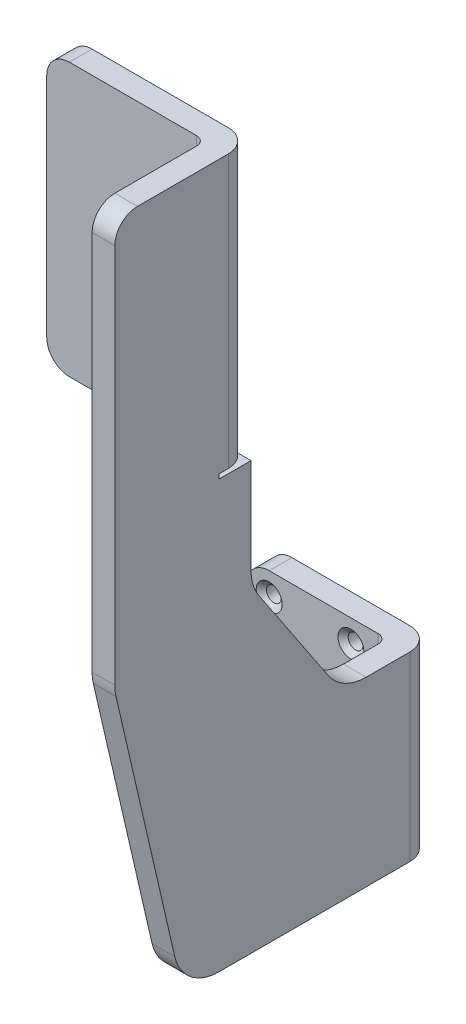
ISO-10303-21;
HEADER;
FILE_DESCRIPTION(('STEP AP214'),'2;1');
FILE_NAME('part.step','',(''),(''),'','','');
FILE_SCHEMA(('AUTOMOTIVE_DESIGN { 1 0 10303 214 1 1 1 1 }'));
ENDSEC;
DATA;
#1=APPLICATION_CONTEXT('core data for automotive mechanical design processes');
#2=APPLICATION_PROTOCOL_DEFINITION('international standard','automotive_design',2000,#1);
#3=PRODUCT_CONTEXT('',#1,'mechanical');
#4=PRODUCT('Part','Part','',(#3));
#5=PRODUCT_RELATED_PRODUCT_CATEGORY('part','',(#4));
#6=PRODUCT_DEFINITION_FORMATION('','',#4);
#7=PRODUCT_DEFINITION_CONTEXT('part definition',#1,'design');
#8=PRODUCT_DEFINITION('design','',#6,#7);
#9=PRODUCT_DEFINITION_SHAPE('','',#8);
#10=(LENGTH_UNIT() NAMED_UNIT(*) SI_UNIT(.MILLI.,.METRE.));
#11=(NAMED_UNIT(*) PLANE_ANGLE_UNIT() SI_UNIT($,.RADIAN.));
#12=(NAMED_UNIT(*) SI_UNIT($,.STERADIAN.) SOLID_ANGLE_UNIT());
#13=UNCERTAINTY_MEASURE_WITH_UNIT(LENGTH_MEASURE(1.E-05),#10,'distance_accuracy_value','');
#14=(GEOMETRIC_REPRESENTATION_CONTEXT(3) GLOBAL_UNCERTAINTY_ASSIGNED_CONTEXT((#13)) GLOBAL_UNIT_ASSIGNED_CONTEXT((#10,
#11,#12)) REPRESENTATION_CONTEXT('',''));
#15=CARTESIAN_POINT('',(0.,0.,0.));
#16=DIRECTION('',(0.,0.,1.));
#17=DIRECTION('',(1.,0.,0.));
#18=AXIS2_PLACEMENT_3D('',#15,#16,#17);
#19=CARTESIAN_POINT('',(29.,40.,7.));
#20=DIRECTION('',(0.,-1.,0.));
#21=DIRECTION('',(0.,0.,-1.));
#22=AXIS2_PLACEMENT_3D('',#19,#20,#21);
#23=CYLINDRICAL_SURFACE('',#22,2.);
#24=DIRECTION('',(0.,1.,0.));
#25=VECTOR('',#24,1.);
#26=CARTESIAN_POINT('',(29.,40.,5.));
#27=LINE('',#26,#25);
#28=CARTESIAN_POINT('',(29.,23.5,5.));
#29=VERTEX_POINT('',#28);
#30=CARTESIAN_POINT('',(29.,40.,5.));
#31=VERTEX_POINT('',#30);
#32=EDGE_CURVE('E388',#29,#31,#27,.T.);
#33=ORIENTED_EDGE('',*,*,#32,.F.);
#34=CARTESIAN_POINT('',(29.,23.5,7.));
#35=DIRECTION('',(0.,-1.,0.));
#36=DIRECTION('',(0.,0.,-1.));
#37=AXIS2_PLACEMENT_3D('',#34,#35,#36);
#38=CIRCLE('',#37,2.);
#39=CARTESIAN_POINT('',(31.,23.5,7.));
#40=VERTEX_POINT('',#39);
#41=EDGE_CURVE('E498',#29,#40,#38,.T.);
#42=ORIENTED_EDGE('',*,*,#41,.T.);
#43=DIRECTION('',(0.,1.,0.));
#44=VECTOR('',#43,1.);
#45=CARTESIAN_POINT('',(31.,0.,7.));
#46=LINE('',#45,#44);
#47=CARTESIAN_POINT('',(31.,40.,7.));
#48=VERTEX_POINT('',#47);
#49=EDGE_CURVE('E398',#48,#40,#46,.F.);
#50=ORIENTED_EDGE('',*,*,#49,.F.);
#51=CARTESIAN_POINT('',(29.,40.,7.));
#52=DIRECTION('',(0.,-1.,0.));
#53=DIRECTION('',(0.,0.,-1.));
#54=AXIS2_PLACEMENT_3D('',#51,#52,#53);
#55=CIRCLE('',#54,2.);
#56=EDGE_CURVE('E654',#31,#48,#55,.T.);
#57=ORIENTED_EDGE('',*,*,#56,.F.);
#58=EDGE_LOOP('',(#33,#42,#50,#57));
#59=FACE_BOUND('',#58,.T.);
#60=ADVANCED_FACE('F37',(#59),#23,.F.);
#61=CARTESIAN_POINT('',(31.,70.,40.));
#62=DIRECTION('',(0.,0.,-1.));
#63=DIRECTION('',(-1.,0.,0.));
#64=AXIS2_PLACEMENT_3D('',#61,#62,#63);
#65=PLANE('',#64);
#66=DIRECTION('',(1.,0.,0.));
#67=VECTOR('',#66,1.);
#68=CARTESIAN_POINT('',(31.,155.,40.));
#69=LINE('',#68,#67);
#70=CARTESIAN_POINT('',(0.999999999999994,155.,40.));
#71=VERTEX_POINT('',#70);
#72=CARTESIAN_POINT('',(31.,155.,40.));
#73=VERTEX_POINT('',#72);
#74=EDGE_CURVE('E342',#71,#73,#69,.T.);
#75=ORIENTED_EDGE('',*,*,#74,.T.);
#76=DIRECTION('',(0.,1.,0.));
#77=VECTOR('',#76,1.);
#78=CARTESIAN_POINT('',(31.,95.,40.));
#79=LINE('',#78,#77);
#80=CARTESIAN_POINT('',(31.,95.,40.));
#81=VERTEX_POINT('',#80);
#82=EDGE_CURVE('E472',#73,#81,#79,.F.);
#83=ORIENTED_EDGE('',*,*,#82,.T.);
#84=DIRECTION('',(1.,0.,0.));
#85=VECTOR('',#84,1.);
#86=CARTESIAN_POINT('',(-4.00000000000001,95.,40.));
#87=LINE('',#86,#85);
#88=CARTESIAN_POINT('',(0.999999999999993,95.,40.));
#89=VERTEX_POINT('',#88);
#90=EDGE_CURVE('E332',#89,#81,#87,.T.);
#91=ORIENTED_EDGE('',*,*,#90,.F.);
#92=CARTESIAN_POINT('',(0.999999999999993,100.,40.));
#93=DIRECTION('',(0.,0.,-1.));
#94=DIRECTION('',(-1.,0.,0.));
#95=AXIS2_PLACEMENT_3D('',#92,#93,#94);
#96=CIRCLE('',#95,5.);
#97=CARTESIAN_POINT('',(-4.00000000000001,100.,40.));
#98=VERTEX_POINT('',#97);
#99=EDGE_CURVE('E462',#89,#98,#96,.T.);
#100=ORIENTED_EDGE('',*,*,#99,.T.);
#101=DIRECTION('',(0.,-1.,0.));
#102=VECTOR('',#101,1.);
#103=CARTESIAN_POINT('',(-4.00000000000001,155.,40.));
#104=LINE('',#103,#102);
#105=CARTESIAN_POINT('',(-4.00000000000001,150.,40.));
#106=VERTEX_POINT('',#105);
#107=EDGE_CURVE('E582',#106,#98,#104,.T.);
#108=ORIENTED_EDGE('',*,*,#107,.F.);
#109=CARTESIAN_POINT('',(0.999999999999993,150.,40.));
#110=DIRECTION('',(0.,0.,-1.));
#111=DIRECTION('',(-1.,0.,0.));
#112=AXIS2_PLACEMENT_3D('',#109,#110,#111);
#113=CIRCLE('',#112,5.);
#114=EDGE_CURVE('E460',#106,#71,#113,.T.);
#115=ORIENTED_EDGE('',*,*,#114,.T.);
#116=EDGE_LOOP('',(#75,#83,#91,#100,#108,#115));
#117=FACE_BOUND('',#116,.T.);
#118=ADVANCED_FACE('F697',(#117),#65,.T.);
#119=CARTESIAN_POINT('',(31.,0.,5.));
#120=DIRECTION('',(1.,0.,0.));
#121=DIRECTION('',(0.,0.,-1.));
#122=AXIS2_PLACEMENT_3D('',#119,#120,#121);
#123=PLANE('',#122);
#124=DIRECTION('',(0.,1.,0.));
#125=VECTOR('',#124,1.);
#126=CARTESIAN_POINT('',(31.,17.5,19.414213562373));
#127=LINE('',#126,#125);
#128=CARTESIAN_POINT('',(31.,23.5,19.414213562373));
#129=VERTEX_POINT('',#128);
#130=CARTESIAN_POINT('',(31.,16.5,19.414213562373));
#131=VERTEX_POINT('',#130);
#132=EDGE_CURVE('E505',#129,#131,#127,.F.);
#133=ORIENTED_EDGE('',*,*,#132,.T.);
#134=DIRECTION('',(0.,0.,1.));
#135=VECTOR('',#134,1.);
#136=CARTESIAN_POINT('',(31.,16.5,5.));
#137=LINE('',#136,#135);
#138=CARTESIAN_POINT('',(31.,16.5,7.));
#139=VERTEX_POINT('',#138);
#140=EDGE_CURVE('E507',#131,#139,#137,.F.);
#141=ORIENTED_EDGE('',*,*,#140,.T.);
#142=CARTESIAN_POINT('',(31.,0.,7.));
#143=VERTEX_POINT('',#142);
#144=EDGE_CURVE('E394',#139,#143,#46,.F.);
#145=ORIENTED_EDGE('',*,*,#144,.T.);
#146=DIRECTION('',(0.,0.,-1.));
#147=VECTOR('',#146,1.);
#148=CARTESIAN_POINT('',(31.,0.,55.));
#149=LINE('',#148,#147);
#150=CARTESIAN_POINT('',(31.,0.,47.0448737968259));
#151=VERTEX_POINT('',#150);
#152=EDGE_CURVE('E327',#151,#143,#149,.T.);
#153=ORIENTED_EDGE('',*,*,#152,.F.);
#154=CARTESIAN_POINT('',(31.,10.,47.0448737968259));
#155=DIRECTION('',(1.,0.,0.));
#156=DIRECTION('',(0.,0.,-1.));
#157=AXIS2_PLACEMENT_3D('',#154,#155,#156);
#158=CIRCLE('',#157,10.);
#159=CARTESIAN_POINT('',(31.,7.75140493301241,56.7887857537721));
#160=VERTEX_POINT('',#159);
#161=EDGE_CURVE('E415',#151,#160,#158,.F.);
#162=ORIENTED_EDGE('',*,*,#161,.T.);
#163=DIRECTION('',(0.,-0.97439119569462,-0.224859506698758));
#164=VECTOR('',#163,1.);
#165=CARTESIAN_POINT('',(31.,65.,70.));
#166=LINE('',#165,#164);
#167=CARTESIAN_POINT('',(31.,63.8902851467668,69.7439119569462));
#168=VERTEX_POINT('',#167);
#169=EDGE_CURVE('E324',#168,#160,#166,.T.);
#170=ORIENTED_EDGE('',*,*,#169,.F.);
#171=CARTESIAN_POINT('',(31.,66.1388802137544,60.));
#172=DIRECTION('',(1.,0.,0.));
#173=DIRECTION('',(0.,0.,-1.));
#174=AXIS2_PLACEMENT_3D('',#171,#172,#173);
#175=CIRCLE('',#174,10.);
#176=CARTESIAN_POINT('',(31.,66.1388802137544,70.));
#177=VERTEX_POINT('',#176);
#178=EDGE_CURVE('E417',#168,#177,#175,.F.);
#179=ORIENTED_EDGE('',*,*,#178,.T.);
#180=DIRECTION('',(0.,-1.,0.));
#181=VECTOR('',#180,1.);
#182=CARTESIAN_POINT('',(31.,155.,70.));
#183=LINE('',#182,#181);
#184=CARTESIAN_POINT('',(31.,150.,70.));
#185=VERTEX_POINT('',#184);
#186=EDGE_CURVE('E315',#185,#177,#183,.T.);
#187=ORIENTED_EDGE('',*,*,#186,.F.);
#188=CARTESIAN_POINT('',(31.,150.,65.));
#189=DIRECTION('',(1.,0.,0.));
#190=DIRECTION('',(0.,0.,-1.));
#191=AXIS2_PLACEMENT_3D('',#188,#189,#190);
#192=CIRCLE('',#191,5.);
#193=CARTESIAN_POINT('',(31.,155.,65.));
#194=VERTEX_POINT('',#193);
#195=EDGE_CURVE('E360',#185,#194,#192,.F.);
#196=ORIENTED_EDGE('',*,*,#195,.T.);
#197=DIRECTION('',(0.,0.,1.));
#198=VECTOR('',#197,1.);
#199=CARTESIAN_POINT('',(31.,155.,40.));
#200=LINE('',#199,#198);
#201=CARTESIAN_POINT('',(31.,155.,47.));
#202=VERTEX_POINT('',#201);
#203=EDGE_CURVE('E312',#202,#194,#200,.T.);
#204=ORIENTED_EDGE('',*,*,#203,.F.);
#205=DIRECTION('',(0.,1.,0.));
#206=VECTOR('',#205,1.);
#207=CARTESIAN_POINT('',(31.,95.,47.));
#208=LINE('',#207,#206);
#209=CARTESIAN_POINT('',(31.,95.,47.));
#210=VERTEX_POINT('',#209);
#211=EDGE_CURVE('E441',#202,#210,#208,.F.);
#212=ORIENTED_EDGE('',*,*,#211,.T.);
#213=DIRECTION('',(0.,1.,0.));
#214=VECTOR('',#213,1.);
#215=CARTESIAN_POINT('',(31.,95.,47.));
#216=LINE('',#215,#214);
#217=CARTESIAN_POINT('',(31.,94.,47.));
#218=VERTEX_POINT('',#217);
#219=EDGE_CURVE('E306',#218,#210,#216,.T.);
#220=ORIENTED_EDGE('',*,*,#219,.F.);
#221=DIRECTION('',(0.,0.,1.));
#222=VECTOR('',#221,1.);
#223=CARTESIAN_POINT('',(31.,94.,40.));
#224=LINE('',#223,#222);
#225=CARTESIAN_POINT('',(31.,94.,40.));
#226=VERTEX_POINT('',#225);
#227=EDGE_CURVE('E289',#226,#218,#224,.T.);
#228=ORIENTED_EDGE('',*,*,#227,.F.);
#229=DIRECTION('',(0.,1.,0.));
#230=VECTOR('',#229,1.);
#231=CARTESIAN_POINT('',(31.,70.,40.));
#232=LINE('',#231,#230);
#233=CARTESIAN_POINT('',(31.,73.0277563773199,40.));
#234=VERTEX_POINT('',#233);
#235=EDGE_CURVE('E303',#234,#226,#232,.T.);
#236=ORIENTED_EDGE('',*,*,#235,.F.);
#237=CARTESIAN_POINT('',(31.,73.0277563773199,30.));
#238=DIRECTION('',(1.,0.,0.));
#239=DIRECTION('',(0.,0.,-1.));
#240=AXIS2_PLACEMENT_3D('',#237,#238,#239);
#241=CIRCLE('',#240,10.);
#242=CARTESIAN_POINT('',(31.,67.4807544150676,38.3205029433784));
#243=VERTEX_POINT('',#242);
#244=EDGE_CURVE('E432',#234,#243,#241,.T.);
#245=ORIENTED_EDGE('',*,*,#244,.T.);
#246=DIRECTION('',(0.,0.832050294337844,0.554700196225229));
#247=VECTOR('',#246,1.);
#248=CARTESIAN_POINT('',(31.,40.,20.));
#249=LINE('',#248,#247);
#250=CARTESIAN_POINT('',(31.,44.4529980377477,22.9686653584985));
#251=VERTEX_POINT('',#250);
#252=EDGE_CURVE('E313',#251,#243,#249,.T.);
#253=ORIENTED_EDGE('',*,*,#252,.F.);
#254=CARTESIAN_POINT('',(31.,50.,14.64816241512));
#255=DIRECTION('',(1.,0.,0.));
#256=DIRECTION('',(0.,0.,-1.));
#257=AXIS2_PLACEMENT_3D('',#254,#255,#256);
#258=CIRCLE('',#257,10.);
#259=CARTESIAN_POINT('',(31.,40.,14.64816241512));
#260=VERTEX_POINT('',#259);
#261=EDGE_CURVE('E436',#251,#260,#258,.T.);
#262=ORIENTED_EDGE('',*,*,#261,.T.);
#263=DIRECTION('',(0.,0.,1.));
#264=VECTOR('',#263,1.);
#265=CARTESIAN_POINT('',(31.,40.,5.));
#266=LINE('',#265,#264);
#267=EDGE_CURVE('E318',#48,#260,#266,.T.);
#268=ORIENTED_EDGE('',*,*,#267,.F.);
#269=ORIENTED_EDGE('',*,*,#49,.T.);
#270=DIRECTION('',(0.,0.,1.));
#271=VECTOR('',#270,1.);
#272=CARTESIAN_POINT('',(31.,23.5,19.));
#273=LINE('',#272,#271);
#274=EDGE_CURVE('E503',#40,#129,#273,.T.);
#275=ORIENTED_EDGE('',*,*,#274,.T.);
#276=EDGE_LOOP('',(#133,#141,#145,#153,#162,#170,#179,#187,#196,#204,#212,#220,#228,#236,#245,
#253,#262,#268,#269,#275));
#277=FACE_BOUND('',#276,.T.);
#278=ADVANCED_FACE('F302',(#277),#123,.F.);
#279=CARTESIAN_POINT('',(0.,0.,5.));
#280=DIRECTION('',(1.,0.,0.));
#281=DIRECTION('',(0.,0.,-1.));
#282=AXIS2_PLACEMENT_3D('',#279,#280,#281);
#283=PLANE('',#282);
#284=DIRECTION('',(0.,-1.,0.));
#285=VECTOR('',#284,1.);
#286=CARTESIAN_POINT('',(0.,0.,0.));
#287=LINE('',#286,#285);
#288=CARTESIAN_POINT('',(0.,35.,0.));
#289=VERTEX_POINT('',#288);
#290=CARTESIAN_POINT('',(0.,5.,0.));
#291=VERTEX_POINT('',#290);
#292=EDGE_CURVE('E345',#289,#291,#287,.T.);
#293=ORIENTED_EDGE('',*,*,#292,.T.);
#294=DIRECTION('',(0.,0.,-1.));
#295=VECTOR('',#294,1.);
#296=CARTESIAN_POINT('',(0.,5.,5.));
#297=LINE('',#296,#295);
#298=CARTESIAN_POINT('',(0.,5.,5.));
#299=VERTEX_POINT('',#298);
#300=EDGE_CURVE('E377',#291,#299,#297,.F.);
#301=ORIENTED_EDGE('',*,*,#300,.T.);
#302=DIRECTION('',(0.,-1.,0.));
#303=VECTOR('',#302,1.);
#304=CARTESIAN_POINT('',(0.,0.,5.));
#305=LINE('',#304,#303);
#306=CARTESIAN_POINT('',(0.,35.,5.));
#307=VERTEX_POINT('',#306);
#308=EDGE_CURVE('E346',#307,#299,#305,.T.);
#309=ORIENTED_EDGE('',*,*,#308,.F.);
#310=DIRECTION('',(0.,0.,-1.));
#311=VECTOR('',#310,1.);
#312=CARTESIAN_POINT('',(0.,35.,5.));
#313=LINE('',#312,#311);
#314=EDGE_CURVE('E374',#307,#289,#313,.T.);
#315=ORIENTED_EDGE('',*,*,#314,.T.);
#316=EDGE_LOOP('',(#293,#301,#309,#315));
#317=FACE_BOUND('',#316,.T.);
#318=ADVANCED_FACE('F633',(#317),#283,.F.);
#319=CARTESIAN_POINT('',(0.,0.,5.));
#320=DIRECTION('',(0.,1.,0.));
#321=DIRECTION('',(0.,0.,1.));
#322=AXIS2_PLACEMENT_3D('',#319,#320,#321);
#323=PLANE('',#322);
#324=DIRECTION('',(0.,0.,-1.));
#325=VECTOR('',#324,1.);
#326=CARTESIAN_POINT('',(36.,0.,5.));
#327=LINE('',#326,#325);
#328=CARTESIAN_POINT('',(36.,0.,47.0448737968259));
#329=VERTEX_POINT('',#328);
#330=CARTESIAN_POINT('',(36.,0.,5.));
#331=VERTEX_POINT('',#330);
#332=EDGE_CURVE('E403',#329,#331,#327,.T.);
#333=ORIENTED_EDGE('',*,*,#332,.F.);
#334=DIRECTION('',(1.,0.,0.));
#335=VECTOR('',#334,1.);
#336=CARTESIAN_POINT('',(31.,0.,47.0448737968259));
#337=LINE('',#336,#335);
#338=EDGE_CURVE('E419',#329,#151,#337,.F.);
#339=ORIENTED_EDGE('',*,*,#338,.T.);
#340=ORIENTED_EDGE('',*,*,#152,.T.);
#341=CARTESIAN_POINT('',(29.,0.,7.));
#342=DIRECTION('',(0.,1.,0.));
#343=DIRECTION('',(0.,0.,1.));
#344=AXIS2_PLACEMENT_3D('',#341,#342,#343);
#345=CIRCLE('',#344,2.);
#346=CARTESIAN_POINT('',(29.,0.,5.));
#347=VERTEX_POINT('',#346);
#348=EDGE_CURVE('E649',#143,#347,#345,.T.);
#349=ORIENTED_EDGE('',*,*,#348,.T.);
#350=DIRECTION('',(1.,0.,0.));
#351=VECTOR('',#350,1.);
#352=CARTESIAN_POINT('',(0.,0.,5.));
#353=LINE('',#352,#351);
#354=CARTESIAN_POINT('',(5.,0.,5.));
#355=VERTEX_POINT('',#354);
#356=EDGE_CURVE('E349',#355,#347,#353,.T.);
#357=ORIENTED_EDGE('',*,*,#356,.F.);
#358=DIRECTION('',(0.,0.,-1.));
#359=VECTOR('',#358,1.);
#360=CARTESIAN_POINT('',(5.,0.,5.));
#361=LINE('',#360,#359);
#362=CARTESIAN_POINT('',(5.,0.,0.));
#363=VERTEX_POINT('',#362);
#364=EDGE_CURVE('E365',#355,#363,#361,.T.);
#365=ORIENTED_EDGE('',*,*,#364,.T.);
#366=DIRECTION('',(1.,0.,0.));
#367=VECTOR('',#366,1.);
#368=CARTESIAN_POINT('',(0.,0.,0.));
#369=LINE('',#368,#367);
#370=CARTESIAN_POINT('',(31.,0.,0.));
#371=VERTEX_POINT('',#370);
#372=EDGE_CURVE('E627',#363,#371,#369,.T.);
#373=ORIENTED_EDGE('',*,*,#372,.T.);
#374=CARTESIAN_POINT('',(31.,0.,5.));
#375=DIRECTION('',(0.,1.,0.));
#376=DIRECTION('',(0.,0.,1.));
#377=AXIS2_PLACEMENT_3D('',#374,#375,#376);
#378=CIRCLE('',#377,5.);
#379=EDGE_CURVE('E362',#371,#331,#378,.F.);
#380=ORIENTED_EDGE('',*,*,#379,.T.);
#381=EDGE_LOOP('',(#333,#339,#340,#349,#357,#365,#373,#380));
#382=FACE_BOUND('',#381,.T.);
#383=ADVANCED_FACE('F646',(#382),#323,.F.);
#384=CARTESIAN_POINT('',(36.,0.,5.));
#385=DIRECTION('',(-1.,0.,0.));
#386=DIRECTION('',(0.,-1.,0.));
#387=AXIS2_PLACEMENT_3D('',#384,#385,#386);
#388=PLANE('',#387);
#389=DIRECTION('',(0.,0.,-1.));
#390=VECTOR('',#389,1.);
#391=CARTESIAN_POINT('',(36.,95.,5.));
#392=LINE('',#391,#390);
#393=CARTESIAN_POINT('',(36.,95.,47.));
#394=VERTEX_POINT('',#393);
#395=CARTESIAN_POINT('',(36.,95.,45.));
#396=VERTEX_POINT('',#395);
#397=EDGE_CURVE('E577',#394,#396,#392,.T.);
#398=ORIENTED_EDGE('',*,*,#397,.T.);
#399=DIRECTION('',(0.,1.,0.));
#400=VECTOR('',#399,1.);
#401=CARTESIAN_POINT('',(36.,155.,45.));
#402=LINE('',#401,#400);
#403=CARTESIAN_POINT('',(36.,155.,45.));
#404=VERTEX_POINT('',#403);
#405=EDGE_CURVE('E467',#396,#404,#402,.T.);
#406=ORIENTED_EDGE('',*,*,#405,.T.);
#407=DIRECTION('',(0.,0.,1.));
#408=VECTOR('',#407,1.);
#409=CARTESIAN_POINT('',(36.,155.,40.));
#410=LINE('',#409,#408);
#411=CARTESIAN_POINT('',(36.,155.,65.));
#412=VERTEX_POINT('',#411);
#413=EDGE_CURVE('E334',#404,#412,#410,.T.);
#414=ORIENTED_EDGE('',*,*,#413,.T.);
#415=CARTESIAN_POINT('',(36.,150.,65.));
#416=DIRECTION('',(-1.,0.,0.));
#417=DIRECTION('',(0.,-1.,0.));
#418=AXIS2_PLACEMENT_3D('',#415,#416,#417);
#419=CIRCLE('',#418,5.);
#420=CARTESIAN_POINT('',(36.,150.,70.));
#421=VERTEX_POINT('',#420);
#422=EDGE_CURVE('E619',#412,#421,#419,.F.);
#423=ORIENTED_EDGE('',*,*,#422,.T.);
#424=DIRECTION('',(0.,-1.,0.));
#425=VECTOR('',#424,1.);
#426=CARTESIAN_POINT('',(36.,155.,70.));
#427=LINE('',#426,#425);
#428=CARTESIAN_POINT('',(36.,66.1388802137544,70.));
#429=VERTEX_POINT('',#428);
#430=EDGE_CURVE('E336',#421,#429,#427,.T.);
#431=ORIENTED_EDGE('',*,*,#430,.T.);
#432=CARTESIAN_POINT('',(36.,66.1388802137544,60.));
#433=DIRECTION('',(-1.,0.,0.));
#434=DIRECTION('',(0.,-1.,0.));
#435=AXIS2_PLACEMENT_3D('',#432,#433,#434);
#436=CIRCLE('',#435,10.);
#437=CARTESIAN_POINT('',(36.,63.8902851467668,69.7439119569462));
#438=VERTEX_POINT('',#437);
#439=EDGE_CURVE('E661',#429,#438,#436,.F.);
#440=ORIENTED_EDGE('',*,*,#439,.T.);
#441=DIRECTION('',(0.,-0.97439119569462,-0.224859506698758));
#442=VECTOR('',#441,1.);
#443=CARTESIAN_POINT('',(36.,65.,70.));
#444=LINE('',#443,#442);
#445=CARTESIAN_POINT('',(36.,7.75140493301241,56.7887857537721));
#446=VERTEX_POINT('',#445);
#447=EDGE_CURVE('E339',#438,#446,#444,.T.);
#448=ORIENTED_EDGE('',*,*,#447,.T.);
#449=CARTESIAN_POINT('',(36.,10.,47.0448737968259));
#450=DIRECTION('',(-1.,0.,0.));
#451=DIRECTION('',(0.,-1.,0.));
#452=AXIS2_PLACEMENT_3D('',#449,#450,#451);
#453=CIRCLE('',#452,10.);
#454=EDGE_CURVE('E657',#446,#329,#453,.F.);
#455=ORIENTED_EDGE('',*,*,#454,.T.);
#456=ORIENTED_EDGE('',*,*,#332,.T.);
#457=DIRECTION('',(0.,1.,0.));
#458=VECTOR('',#457,1.);
#459=CARTESIAN_POINT('',(36.,40.,5.));
#460=LINE('',#459,#458);
#461=CARTESIAN_POINT('',(36.,40.,5.));
#462=VERTEX_POINT('',#461);
#463=EDGE_CURVE('E617',#331,#462,#460,.T.);
#464=ORIENTED_EDGE('',*,*,#463,.T.);
#465=DIRECTION('',(0.,0.,-1.));
#466=VECTOR('',#465,1.);
#467=CARTESIAN_POINT('',(36.,40.,5.));
#468=LINE('',#467,#466);
#469=CARTESIAN_POINT('',(36.,40.,14.64816241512));
#470=VERTEX_POINT('',#469);
#471=EDGE_CURVE('E390',#470,#462,#468,.T.);
#472=ORIENTED_EDGE('',*,*,#471,.F.);
#473=CARTESIAN_POINT('',(36.,50.,14.64816241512));
#474=DIRECTION('',(-1.,0.,0.));
#475=DIRECTION('',(0.,-1.,0.));
#476=AXIS2_PLACEMENT_3D('',#473,#474,#475);
#477=CIRCLE('',#476,10.);
#478=CARTESIAN_POINT('',(36.,44.4529980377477,22.9686653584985));
#479=VERTEX_POINT('',#478);
#480=EDGE_CURVE('E434',#470,#479,#477,.T.);
#481=ORIENTED_EDGE('',*,*,#480,.T.);
#482=DIRECTION('',(0.,0.832050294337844,0.554700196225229));
#483=VECTOR('',#482,1.);
#484=CARTESIAN_POINT('',(36.,40.,20.));
#485=LINE('',#484,#483);
#486=CARTESIAN_POINT('',(36.,67.4807544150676,38.3205029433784));
#487=VERTEX_POINT('',#486);
#488=EDGE_CURVE('E328',#479,#487,#485,.T.);
#489=ORIENTED_EDGE('',*,*,#488,.T.);
#490=CARTESIAN_POINT('',(36.,73.0277563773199,30.));
#491=DIRECTION('',(-1.,0.,0.));
#492=DIRECTION('',(0.,-1.,0.));
#493=AXIS2_PLACEMENT_3D('',#490,#491,#492);
#494=CIRCLE('',#493,10.);
#495=CARTESIAN_POINT('',(36.,73.0277563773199,40.));
#496=VERTEX_POINT('',#495);
#497=EDGE_CURVE('E430',#487,#496,#494,.T.);
#498=ORIENTED_EDGE('',*,*,#497,.T.);
#499=DIRECTION('',(0.,1.,0.));
#500=VECTOR('',#499,1.);
#501=CARTESIAN_POINT('',(36.,70.,40.));
#502=LINE('',#501,#500);
#503=CARTESIAN_POINT('',(36.,94.,40.));
#504=VERTEX_POINT('',#503);
#505=EDGE_CURVE('E331',#496,#504,#502,.T.);
#506=ORIENTED_EDGE('',*,*,#505,.T.);
#507=DIRECTION('',(0.,0.,1.));
#508=VECTOR('',#507,1.);
#509=CARTESIAN_POINT('',(36.,94.,5.));
#510=LINE('',#509,#508);
#511=CARTESIAN_POINT('',(36.,94.,47.));
#512=VERTEX_POINT('',#511);
#513=EDGE_CURVE('E292',#504,#512,#510,.T.);
#514=ORIENTED_EDGE('',*,*,#513,.T.);
#515=DIRECTION('',(0.,1.,0.));
#516=VECTOR('',#515,1.);
#517=CARTESIAN_POINT('',(36.,2.91433543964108E-13,47.0000000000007));
#518=LINE('',#517,#516);
#519=EDGE_CURVE('E297',#512,#394,#518,.T.);
#520=ORIENTED_EDGE('',*,*,#519,.T.);
#521=EDGE_LOOP('',(#398,#406,#414,#423,#431,#440,#448,#455,#456,#464,#472,#481,#489,#498,#506,
#514,#520));
#522=FACE_BOUND('',#521,.T.);
#523=ADVANCED_FACE('F606',(#522),#388,.F.);
#524=CARTESIAN_POINT('',(0.,40.,5.));
#525=DIRECTION('',(0.,-1.,0.));
#526=DIRECTION('',(0.,0.,-1.));
#527=AXIS2_PLACEMENT_3D('',#524,#525,#526);
#528=PLANE('',#527);
#529=ORIENTED_EDGE('',*,*,#267,.T.);
#530=DIRECTION('',(1.,0.,0.));
#531=VECTOR('',#530,1.);
#532=CARTESIAN_POINT('',(0.,40.,14.64816241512));
#533=LINE('',#532,#531);
#534=EDGE_CURVE('E427',#260,#470,#533,.T.);
#535=ORIENTED_EDGE('',*,*,#534,.T.);
#536=ORIENTED_EDGE('',*,*,#471,.T.);
#537=CARTESIAN_POINT('',(31.,40.,5.));
#538=DIRECTION('',(0.,-1.,0.));
#539=DIRECTION('',(0.,0.,-1.));
#540=AXIS2_PLACEMENT_3D('',#537,#538,#539);
#541=CIRCLE('',#540,5.);
#542=CARTESIAN_POINT('',(31.,40.,0.));
#543=VERTEX_POINT('',#542);
#544=EDGE_CURVE('E383',#462,#543,#541,.F.);
#545=ORIENTED_EDGE('',*,*,#544,.T.);
#546=DIRECTION('',(-1.,0.,0.));
#547=VECTOR('',#546,1.);
#548=CARTESIAN_POINT('',(0.,40.,0.));
#549=LINE('',#548,#547);
#550=CARTESIAN_POINT('',(5.,40.,0.));
#551=VERTEX_POINT('',#550);
#552=EDGE_CURVE('E350',#543,#551,#549,.T.);
#553=ORIENTED_EDGE('',*,*,#552,.T.);
#554=DIRECTION('',(0.,0.,-1.));
#555=VECTOR('',#554,1.);
#556=CARTESIAN_POINT('',(5.,40.,5.));
#557=LINE('',#556,#555);
#558=CARTESIAN_POINT('',(5.,40.,5.));
#559=VERTEX_POINT('',#558);
#560=EDGE_CURVE('E385',#551,#559,#557,.F.);
#561=ORIENTED_EDGE('',*,*,#560,.T.);
#562=DIRECTION('',(-1.,0.,0.));
#563=VECTOR('',#562,1.);
#564=CARTESIAN_POINT('',(0.,40.,5.));
#565=LINE('',#564,#563);
#566=EDGE_CURVE('E359',#31,#559,#565,.T.);
#567=ORIENTED_EDGE('',*,*,#566,.F.);
#568=ORIENTED_EDGE('',*,*,#56,.T.);
#569=EDGE_LOOP('',(#529,#535,#536,#545,#553,#561,#567,#568));
#570=FACE_BOUND('',#569,.T.);
#571=ADVANCED_FACE('F808',(#570),#528,.F.);
#572=CARTESIAN_POINT('',(0.,40.,5.));
#573=DIRECTION('',(0.,0.,-1.));
#574=DIRECTION('',(-1.,0.,0.));
#575=AXIS2_PLACEMENT_3D('',#572,#573,#574);
#576=PLANE('',#575);
#577=CARTESIAN_POINT('',(5.,35.,5.));
#578=DIRECTION('',(0.,0.,1.));
#579=DIRECTION('',(1.,0.,0.));
#580=AXIS2_PLACEMENT_3D('',#577,#578,#579);
#581=CIRCLE('',#580,2.8575);
#582=CARTESIAN_POINT('',(7.8575,35.,5.));
#583=VERTEX_POINT('',#582);
#584=EDGE_CURVE('E1122',#583,#583,#581,.T.);
#585=ORIENTED_EDGE('',*,*,#584,.F.);
#586=EDGE_LOOP('',(#585));
#587=FACE_BOUND('',#586,.T.);
#588=CARTESIAN_POINT('',(23.,35.,5.));
#589=DIRECTION('',(0.,0.,1.));
#590=DIRECTION('',(1.,0.,0.));
#591=AXIS2_PLACEMENT_3D('',#588,#589,#590);
#592=CIRCLE('',#591,2.8575);
#593=CARTESIAN_POINT('',(25.8575,35.,5.));
#594=VERTEX_POINT('',#593);
#595=EDGE_CURVE('E554',#594,#594,#592,.T.);
#596=ORIENTED_EDGE('',*,*,#595,.F.);
#597=EDGE_LOOP('',(#596));
#598=FACE_BOUND('',#597,.T.);
#599=CARTESIAN_POINT('',(5.,5.,5.));
#600=DIRECTION('',(0.,0.,1.));
#601=DIRECTION('',(1.,0.,0.));
#602=AXIS2_PLACEMENT_3D('',#599,#600,#601);
#603=CIRCLE('',#602,2.8575);
#604=CARTESIAN_POINT('',(7.8575,5.,5.));
#605=VERTEX_POINT('',#604);
#606=EDGE_CURVE('E547',#605,#605,#603,.T.);
#607=ORIENTED_EDGE('',*,*,#606,.F.);
#608=EDGE_LOOP('',(#607));
#609=FACE_BOUND('',#608,.T.);
#610=CARTESIAN_POINT('',(23.,5.,5.));
#611=DIRECTION('',(0.,0.,1.));
#612=DIRECTION('',(1.,0.,0.));
#613=AXIS2_PLACEMENT_3D('',#610,#611,#612);
#614=CIRCLE('',#613,2.8575);
#615=CARTESIAN_POINT('',(25.8575,5.,5.));
#616=VERTEX_POINT('',#615);
#617=EDGE_CURVE('E543',#616,#616,#614,.T.);
#618=ORIENTED_EDGE('',*,*,#617,.F.);
#619=EDGE_LOOP('',(#618));
#620=FACE_BOUND('',#619,.T.);
#621=CARTESIAN_POINT('',(29.,16.5,5.));
#622=VERTEX_POINT('',#621);
#623=EDGE_CURVE('E391',#347,#622,#27,.T.);
#624=ORIENTED_EDGE('',*,*,#623,.T.);
#625=DIRECTION('',(1.,0.,0.));
#626=VECTOR('',#625,1.);
#627=CARTESIAN_POINT('',(0.,16.5,5.));
#628=LINE('',#627,#626);
#629=CARTESIAN_POINT('',(16.5857864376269,16.5,5.));
#630=VERTEX_POINT('',#629);
#631=EDGE_CURVE('E487',#622,#630,#628,.F.);
#632=ORIENTED_EDGE('',*,*,#631,.T.);
#633=DIRECTION('',(0.,1.,0.));
#634=VECTOR('',#633,1.);
#635=CARTESIAN_POINT('',(16.5857864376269,22.5,5.));
#636=LINE('',#635,#634);
#637=CARTESIAN_POINT('',(16.5857864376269,23.5,5.));
#638=VERTEX_POINT('',#637);
#639=EDGE_CURVE('E483',#630,#638,#636,.T.);
#640=ORIENTED_EDGE('',*,*,#639,.T.);
#641=DIRECTION('',(1.,0.,0.));
#642=VECTOR('',#641,1.);
#643=CARTESIAN_POINT('',(29.,23.5,5.));
#644=LINE('',#643,#642);
#645=EDGE_CURVE('E485',#638,#29,#644,.T.);
#646=ORIENTED_EDGE('',*,*,#645,.T.);
#647=ORIENTED_EDGE('',*,*,#32,.T.);
#648=ORIENTED_EDGE('',*,*,#566,.T.);
#649=CARTESIAN_POINT('',(5.,35.,5.));
#650=DIRECTION('',(0.,0.,-1.));
#651=DIRECTION('',(-1.,0.,0.));
#652=AXIS2_PLACEMENT_3D('',#649,#650,#651);
#653=CIRCLE('',#652,5.);
#654=EDGE_CURVE('E379',#559,#307,#653,.F.);
#655=ORIENTED_EDGE('',*,*,#654,.T.);
#656=ORIENTED_EDGE('',*,*,#308,.T.);
#657=CARTESIAN_POINT('',(5.,5.,5.));
#658=DIRECTION('',(0.,0.,-1.));
#659=DIRECTION('',(-1.,0.,0.));
#660=AXIS2_PLACEMENT_3D('',#657,#658,#659);
#661=CIRCLE('',#660,5.);
#662=EDGE_CURVE('E381',#299,#355,#661,.F.);
#663=ORIENTED_EDGE('',*,*,#662,.T.);
#664=ORIENTED_EDGE('',*,*,#356,.T.);
#665=EDGE_LOOP('',(#624,#632,#640,#646,#647,#648,#655,#656,#663,#664));
#666=FACE_BOUND('',#665,.T.);
#667=ADVANCED_FACE('F643',(#587,#598,#609,#620,#666),#576,.F.);
#668=CARTESIAN_POINT('',(0.,40.,0.));
#669=DIRECTION('',(0.,0.,-1.));
#670=DIRECTION('',(-1.,0.,0.));
#671=AXIS2_PLACEMENT_3D('',#668,#669,#670);
#672=PLANE('',#671);
#673=CARTESIAN_POINT('',(5.,35.,0.));
#674=DIRECTION('',(0.,0.,-1.));
#675=DIRECTION('',(-1.,0.,0.));
#676=AXIS2_PLACEMENT_3D('',#673,#674,#675);
#677=CIRCLE('',#676,1.63194999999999);
#678=CARTESIAN_POINT('',(3.36805000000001,35.,0.));
#679=VERTEX_POINT('',#678);
#680=EDGE_CURVE('E41',#679,#679,#677,.T.);
#681=ORIENTED_EDGE('',*,*,#680,.F.);
#682=EDGE_LOOP('',(#681));
#683=FACE_BOUND('',#682,.T.);
#684=CARTESIAN_POINT('',(23.,35.,0.));
#685=DIRECTION('',(0.,0.,-1.));
#686=DIRECTION('',(-1.,0.,0.));
#687=AXIS2_PLACEMENT_3D('',#684,#685,#686);
#688=CIRCLE('',#687,1.63194999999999);
#689=CARTESIAN_POINT('',(21.36805,35.,0.));
#690=VERTEX_POINT('',#689);
#691=EDGE_CURVE('E545',#690,#690,#688,.T.);
#692=ORIENTED_EDGE('',*,*,#691,.F.);
#693=EDGE_LOOP('',(#692));
#694=FACE_BOUND('',#693,.T.);
#695=CARTESIAN_POINT('',(5.,5.,0.));
#696=DIRECTION('',(0.,0.,-1.));
#697=DIRECTION('',(-1.,0.,0.));
#698=AXIS2_PLACEMENT_3D('',#695,#696,#697);
#699=CIRCLE('',#698,1.63194999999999);
#700=CARTESIAN_POINT('',(3.36805000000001,5.,0.));
#701=VERTEX_POINT('',#700);
#702=EDGE_CURVE('E541',#701,#701,#699,.T.);
#703=ORIENTED_EDGE('',*,*,#702,.F.);
#704=EDGE_LOOP('',(#703));
#705=FACE_BOUND('',#704,.T.);
#706=CARTESIAN_POINT('',(23.,5.,0.));
#707=DIRECTION('',(0.,0.,-1.));
#708=DIRECTION('',(-1.,0.,0.));
#709=AXIS2_PLACEMENT_3D('',#706,#707,#708);
#710=CIRCLE('',#709,1.63194999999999);
#711=CARTESIAN_POINT('',(21.36805,5.,0.));
#712=VERTEX_POINT('',#711);
#713=EDGE_CURVE('E518',#712,#712,#710,.T.);
#714=ORIENTED_EDGE('',*,*,#713,.F.);
#715=EDGE_LOOP('',(#714));
#716=FACE_BOUND('',#715,.T.);
#717=ORIENTED_EDGE('',*,*,#372,.F.);
#718=CARTESIAN_POINT('',(5.,5.,0.));
#719=DIRECTION('',(0.,0.,-1.));
#720=DIRECTION('',(-1.,0.,0.));
#721=AXIS2_PLACEMENT_3D('',#718,#719,#720);
#722=CIRCLE('',#721,5.);
#723=EDGE_CURVE('E372',#363,#291,#722,.T.);
#724=ORIENTED_EDGE('',*,*,#723,.T.);
#725=ORIENTED_EDGE('',*,*,#292,.F.);
#726=CARTESIAN_POINT('',(5.,35.,0.));
#727=DIRECTION('',(0.,0.,-1.));
#728=DIRECTION('',(-1.,0.,0.));
#729=AXIS2_PLACEMENT_3D('',#726,#727,#728);
#730=CIRCLE('',#729,5.);
#731=EDGE_CURVE('E370',#289,#551,#730,.T.);
#732=ORIENTED_EDGE('',*,*,#731,.T.);
#733=ORIENTED_EDGE('',*,*,#552,.F.);
#734=DIRECTION('',(0.,1.,0.));
#735=VECTOR('',#734,1.);
#736=CARTESIAN_POINT('',(31.,0.,0.));
#737=LINE('',#736,#735);
#738=EDGE_CURVE('E368',#543,#371,#737,.F.);
#739=ORIENTED_EDGE('',*,*,#738,.T.);
#740=EDGE_LOOP('',(#717,#724,#725,#732,#733,#739));
#741=FACE_BOUND('',#740,.T.);
#742=ADVANCED_FACE('F800',(#683,#694,#705,#716,#741),#672,.T.);
#743=CARTESIAN_POINT('',(31.,65.,70.));
#744=DIRECTION('',(0.,-0.224859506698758,0.97439119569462));
#745=DIRECTION('',(0.,-0.97439119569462,-0.224859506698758));
#746=AXIS2_PLACEMENT_3D('',#743,#744,#745);
#747=PLANE('',#746);
#748=ORIENTED_EDGE('',*,*,#447,.F.);
#749=DIRECTION('',(1.,0.,0.));
#750=VECTOR('',#749,1.);
#751=CARTESIAN_POINT('',(31.,63.8902851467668,69.7439119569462));
#752=LINE('',#751,#750);
#753=EDGE_CURVE('E413',#438,#168,#752,.F.);
#754=ORIENTED_EDGE('',*,*,#753,.T.);
#755=ORIENTED_EDGE('',*,*,#169,.T.);
#756=DIRECTION('',(1.,0.,0.));
#757=VECTOR('',#756,1.);
#758=CARTESIAN_POINT('',(36.,7.75140493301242,56.7887857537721));
#759=LINE('',#758,#757);
#760=EDGE_CURVE('E662',#160,#446,#759,.T.);
#761=ORIENTED_EDGE('',*,*,#760,.T.);
#762=EDGE_LOOP('',(#748,#754,#755,#761));
#763=FACE_BOUND('',#762,.T.);
#764=ADVANCED_FACE('F669',(#763),#747,.T.);
#765=CARTESIAN_POINT('',(31.,155.,70.));
#766=DIRECTION('',(0.,0.,1.));
#767=DIRECTION('',(0.,-1.,0.));
#768=AXIS2_PLACEMENT_3D('',#765,#766,#767);
#769=PLANE('',#768);
#770=ORIENTED_EDGE('',*,*,#186,.T.);
#771=DIRECTION('',(1.,0.,0.));
#772=VECTOR('',#771,1.);
#773=CARTESIAN_POINT('',(31.,66.1388802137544,70.));
#774=LINE('',#773,#772);
#775=EDGE_CURVE('E653',#177,#429,#774,.T.);
#776=ORIENTED_EDGE('',*,*,#775,.T.);
#777=ORIENTED_EDGE('',*,*,#430,.F.);
#778=DIRECTION('',(1.,0.,0.));
#779=VECTOR('',#778,1.);
#780=CARTESIAN_POINT('',(31.,150.,70.));
#781=LINE('',#780,#779);
#782=EDGE_CURVE('E680',#421,#185,#781,.F.);
#783=ORIENTED_EDGE('',*,*,#782,.T.);
#784=EDGE_LOOP('',(#770,#776,#777,#783));
#785=FACE_BOUND('',#784,.T.);
#786=ADVANCED_FACE('F678',(#785),#769,.T.);
#787=CARTESIAN_POINT('',(31.,155.,40.));
#788=DIRECTION('',(0.,1.,0.));
#789=DIRECTION('',(0.,0.,1.));
#790=AXIS2_PLACEMENT_3D('',#787,#788,#789);
#791=PLANE('',#790);
#792=ORIENTED_EDGE('',*,*,#413,.F.);
#793=CARTESIAN_POINT('',(31.,155.,45.));
#794=DIRECTION('',(0.,1.,0.));
#795=DIRECTION('',(0.,0.,1.));
#796=AXIS2_PLACEMENT_3D('',#793,#794,#795);
#797=CIRCLE('',#796,5.);
#798=EDGE_CURVE('E470',#404,#73,#797,.T.);
#799=ORIENTED_EDGE('',*,*,#798,.T.);
#800=ORIENTED_EDGE('',*,*,#74,.F.);
#801=DIRECTION('',(0.,0.,-1.));
#802=VECTOR('',#801,1.);
#803=CARTESIAN_POINT('',(0.999999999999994,155.,40.));
#804=LINE('',#803,#802);
#805=CARTESIAN_POINT('',(0.999999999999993,155.,45.));
#806=VERTEX_POINT('',#805);
#807=EDGE_CURVE('E298',#71,#806,#804,.F.);
#808=ORIENTED_EDGE('',*,*,#807,.T.);
#809=DIRECTION('',(1.,0.,0.));
#810=VECTOR('',#809,1.);
#811=CARTESIAN_POINT('',(-4.00000000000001,155.,45.));
#812=LINE('',#811,#810);
#813=CARTESIAN_POINT('',(29.,155.,45.));
#814=VERTEX_POINT('',#813);
#815=EDGE_CURVE('E588',#806,#814,#812,.T.);
#816=ORIENTED_EDGE('',*,*,#815,.T.);
#817=CARTESIAN_POINT('',(29.,155.,47.));
#818=DIRECTION('',(0.,1.,0.));
#819=DIRECTION('',(0.,0.,1.));
#820=AXIS2_PLACEMENT_3D('',#817,#818,#819);
#821=CIRCLE('',#820,2.);
#822=EDGE_CURVE('E443',#814,#202,#821,.F.);
#823=ORIENTED_EDGE('',*,*,#822,.T.);
#824=ORIENTED_EDGE('',*,*,#203,.T.);
#825=DIRECTION('',(1.,0.,0.));
#826=VECTOR('',#825,1.);
#827=CARTESIAN_POINT('',(31.,155.,65.));
#828=LINE('',#827,#826);
#829=EDGE_CURVE('E407',#194,#412,#828,.T.);
#830=ORIENTED_EDGE('',*,*,#829,.T.);
#831=EDGE_LOOP('',(#792,#799,#800,#808,#816,#823,#824,#830));
#832=FACE_BOUND('',#831,.T.);
#833=ADVANCED_FACE('F610',(#832),#791,.T.);
#834=DIRECTION('',(-1.,0.,0.));
#835=VECTOR('',#834,1.);
#836=CARTESIAN_POINT('',(31.,94.,40.));
#837=LINE('',#836,#835);
#838=EDGE_CURVE('E285',#504,#226,#837,.T.);
#839=ORIENTED_EDGE('',*,*,#838,.F.);
#840=ORIENTED_EDGE('',*,*,#505,.F.);
#841=DIRECTION('',(1.,0.,0.));
#842=VECTOR('',#841,1.);
#843=CARTESIAN_POINT('',(31.,73.0277563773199,40.));
#844=LINE('',#843,#842);
#845=EDGE_CURVE('E311',#496,#234,#844,.F.);
#846=ORIENTED_EDGE('',*,*,#845,.T.);
#847=ORIENTED_EDGE('',*,*,#235,.T.);
#848=EDGE_LOOP('',(#839,#840,#846,#847));
#849=FACE_BOUND('',#848,.T.);
#850=ADVANCED_FACE('F309',(#849),#65,.T.);
#851=CARTESIAN_POINT('',(31.,40.,20.));
#852=DIRECTION('',(0.,0.554700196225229,-0.832050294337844));
#853=DIRECTION('',(0.,0.832050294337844,0.554700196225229));
#854=AXIS2_PLACEMENT_3D('',#851,#852,#853);
#855=PLANE('',#854);
#856=ORIENTED_EDGE('',*,*,#252,.T.);
#857=DIRECTION('',(1.,0.,0.));
#858=VECTOR('',#857,1.);
#859=CARTESIAN_POINT('',(36.,67.4807544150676,38.3205029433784));
#860=LINE('',#859,#858);
#861=EDGE_CURVE('E423',#243,#487,#860,.T.);
#862=ORIENTED_EDGE('',*,*,#861,.T.);
#863=ORIENTED_EDGE('',*,*,#488,.F.);
#864=DIRECTION('',(1.,0.,0.));
#865=VECTOR('',#864,1.);
#866=CARTESIAN_POINT('',(31.,44.4529980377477,22.9686653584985));
#867=LINE('',#866,#865);
#868=EDGE_CURVE('E421',#479,#251,#867,.F.);
#869=ORIENTED_EDGE('',*,*,#868,.T.);
#870=EDGE_LOOP('',(#856,#862,#863,#869));
#871=FACE_BOUND('',#870,.T.);
#872=ADVANCED_FACE('F685',(#871),#855,.T.);
#873=CARTESIAN_POINT('',(31.,150.,65.));
#874=DIRECTION('',(1.,0.,0.));
#875=DIRECTION('',(0.,0.,-1.));
#876=AXIS2_PLACEMENT_3D('',#873,#874,#875);
#877=CYLINDRICAL_SURFACE('',#876,5.);
#878=ORIENTED_EDGE('',*,*,#195,.F.);
#879=ORIENTED_EDGE('',*,*,#782,.F.);
#880=ORIENTED_EDGE('',*,*,#422,.F.);
#881=ORIENTED_EDGE('',*,*,#829,.F.);
#882=EDGE_LOOP('',(#878,#879,#880,#881));
#883=FACE_BOUND('',#882,.T.);
#884=ADVANCED_FACE('F683',(#883),#877,.T.);
#885=CARTESIAN_POINT('',(5.,5.,5.));
#886=DIRECTION('',(0.,0.,-1.));
#887=DIRECTION('',(-1.,0.,0.));
#888=AXIS2_PLACEMENT_3D('',#885,#886,#887);
#889=CYLINDRICAL_SURFACE('',#888,5.);
#890=ORIENTED_EDGE('',*,*,#662,.F.);
#891=ORIENTED_EDGE('',*,*,#300,.F.);
#892=ORIENTED_EDGE('',*,*,#723,.F.);
#893=ORIENTED_EDGE('',*,*,#364,.F.);
#894=EDGE_LOOP('',(#890,#891,#892,#893));
#895=FACE_BOUND('',#894,.T.);
#896=ADVANCED_FACE('F639',(#895),#889,.T.);
#897=CARTESIAN_POINT('',(5.,35.,5.));
#898=DIRECTION('',(0.,0.,-1.));
#899=DIRECTION('',(-1.,0.,0.));
#900=AXIS2_PLACEMENT_3D('',#897,#898,#899);
#901=CYLINDRICAL_SURFACE('',#900,5.);
#902=ORIENTED_EDGE('',*,*,#654,.F.);
#903=ORIENTED_EDGE('',*,*,#560,.F.);
#904=ORIENTED_EDGE('',*,*,#731,.F.);
#905=ORIENTED_EDGE('',*,*,#314,.F.);
#906=EDGE_LOOP('',(#902,#903,#904,#905));
#907=FACE_BOUND('',#906,.T.);
#908=ADVANCED_FACE('F691',(#907),#901,.T.);
#909=CARTESIAN_POINT('',(31.,0.,5.));
#910=DIRECTION('',(0.,-1.,0.));
#911=DIRECTION('',(1.,0.,0.));
#912=AXIS2_PLACEMENT_3D('',#909,#910,#911);
#913=CYLINDRICAL_SURFACE('',#912,5.);
#914=ORIENTED_EDGE('',*,*,#379,.F.);
#915=ORIENTED_EDGE('',*,*,#738,.F.);
#916=ORIENTED_EDGE('',*,*,#544,.F.);
#917=ORIENTED_EDGE('',*,*,#463,.F.);
#918=EDGE_LOOP('',(#914,#915,#916,#917));
#919=FACE_BOUND('',#918,.T.);
#920=ADVANCED_FACE('F709',(#919),#913,.T.);
#921=ORIENTED_EDGE('',*,*,#144,.F.);
#922=CARTESIAN_POINT('',(29.,16.5,7.));
#923=DIRECTION('',(0.,-1.,0.));
#924=DIRECTION('',(0.,0.,-1.));
#925=AXIS2_PLACEMENT_3D('',#922,#923,#924);
#926=CIRCLE('',#925,2.);
#927=EDGE_CURVE('E490',#139,#622,#926,.F.);
#928=ORIENTED_EDGE('',*,*,#927,.T.);
#929=ORIENTED_EDGE('',*,*,#623,.F.);
#930=ORIENTED_EDGE('',*,*,#348,.F.);
#931=EDGE_LOOP('',(#921,#928,#929,#930));
#932=FACE_BOUND('',#931,.T.);
#933=ADVANCED_FACE('F700',(#932),#23,.F.);
#934=CARTESIAN_POINT('',(31.,66.1388802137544,60.));
#935=DIRECTION('',(1.,0.,0.));
#936=DIRECTION('',(0.,0.,-1.));
#937=AXIS2_PLACEMENT_3D('',#934,#935,#936);
#938=CYLINDRICAL_SURFACE('',#937,10.);
#939=ORIENTED_EDGE('',*,*,#178,.F.);
#940=ORIENTED_EDGE('',*,*,#753,.F.);
#941=ORIENTED_EDGE('',*,*,#439,.F.);
#942=ORIENTED_EDGE('',*,*,#775,.F.);
#943=EDGE_LOOP('',(#939,#940,#941,#942));
#944=FACE_BOUND('',#943,.T.);
#945=ADVANCED_FACE('F675',(#944),#938,.T.);
#946=CARTESIAN_POINT('',(31.,10.,47.0448737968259));
#947=DIRECTION('',(-1.,0.,0.));
#948=DIRECTION('',(0.,0.,1.));
#949=AXIS2_PLACEMENT_3D('',#946,#947,#948);
#950=CYLINDRICAL_SURFACE('',#949,10.);
#951=ORIENTED_EDGE('',*,*,#161,.F.);
#952=ORIENTED_EDGE('',*,*,#338,.F.);
#953=ORIENTED_EDGE('',*,*,#454,.F.);
#954=ORIENTED_EDGE('',*,*,#760,.F.);
#955=EDGE_LOOP('',(#951,#952,#953,#954));
#956=FACE_BOUND('',#955,.T.);
#957=ADVANCED_FACE('F714',(#956),#950,.T.);
#958=CARTESIAN_POINT('',(31.,73.0277563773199,30.));
#959=DIRECTION('',(-1.,0.,0.));
#960=DIRECTION('',(0.,0.,1.));
#961=AXIS2_PLACEMENT_3D('',#958,#959,#960);
#962=CYLINDRICAL_SURFACE('',#961,10.);
#963=ORIENTED_EDGE('',*,*,#244,.F.);
#964=ORIENTED_EDGE('',*,*,#845,.F.);
#965=ORIENTED_EDGE('',*,*,#497,.F.);
#966=ORIENTED_EDGE('',*,*,#861,.F.);
#967=EDGE_LOOP('',(#963,#964,#965,#966));
#968=FACE_BOUND('',#967,.T.);
#969=ADVANCED_FACE('F888',(#968),#962,.F.);
#970=CARTESIAN_POINT('',(0.,50.,14.64816241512));
#971=DIRECTION('',(1.,0.,0.));
#972=DIRECTION('',(0.,0.,-1.));
#973=AXIS2_PLACEMENT_3D('',#970,#971,#972);
#974=CYLINDRICAL_SURFACE('',#973,10.);
#975=ORIENTED_EDGE('',*,*,#261,.F.);
#976=ORIENTED_EDGE('',*,*,#868,.F.);
#977=ORIENTED_EDGE('',*,*,#480,.F.);
#978=ORIENTED_EDGE('',*,*,#534,.F.);
#979=EDGE_LOOP('',(#975,#976,#977,#978));
#980=FACE_BOUND('',#979,.T.);
#981=ADVANCED_FACE('F795',(#980),#974,.F.);
#982=CARTESIAN_POINT('',(-4.00000000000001,95.,40.));
#983=DIRECTION('',(0.,1.,0.));
#984=DIRECTION('',(0.,0.,1.));
#985=AXIS2_PLACEMENT_3D('',#982,#983,#984);
#986=PLANE('',#985);
#987=ORIENTED_EDGE('',*,*,#90,.T.);
#988=CARTESIAN_POINT('',(31.,95.,45.));
#989=DIRECTION('',(0.,1.,0.));
#990=DIRECTION('',(0.,0.,1.));
#991=AXIS2_PLACEMENT_3D('',#988,#989,#990);
#992=CIRCLE('',#991,5.);
#993=EDGE_CURVE('E474',#81,#396,#992,.F.);
#994=ORIENTED_EDGE('',*,*,#993,.T.);
#995=ORIENTED_EDGE('',*,*,#397,.F.);
#996=DIRECTION('',(-1.,0.,0.));
#997=VECTOR('',#996,1.);
#998=CARTESIAN_POINT('',(41.,95.,47.));
#999=LINE('',#998,#997);
#1000=EDGE_CURVE('E574',#394,#210,#999,.T.);
#1001=ORIENTED_EDGE('',*,*,#1000,.T.);
#1002=CARTESIAN_POINT('',(29.,95.,47.));
#1003=DIRECTION('',(0.,1.,0.));
#1004=DIRECTION('',(0.,0.,1.));
#1005=AXIS2_PLACEMENT_3D('',#1002,#1003,#1004);
#1006=CIRCLE('',#1005,2.);
#1007=CARTESIAN_POINT('',(29.,95.,45.));
#1008=VERTEX_POINT('',#1007);
#1009=EDGE_CURVE('E445',#210,#1008,#1006,.T.);
#1010=ORIENTED_EDGE('',*,*,#1009,.T.);
#1011=DIRECTION('',(1.,0.,0.));
#1012=VECTOR('',#1011,1.);
#1013=CARTESIAN_POINT('',(-4.00000000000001,95.,45.));
#1014=LINE('',#1013,#1012);
#1015=CARTESIAN_POINT('',(0.999999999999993,95.,45.));
#1016=VERTEX_POINT('',#1015);
#1017=EDGE_CURVE('E590',#1016,#1008,#1014,.T.);
#1018=ORIENTED_EDGE('',*,*,#1017,.F.);
#1019=DIRECTION('',(0.,0.,1.));
#1020=VECTOR('',#1019,1.);
#1021=CARTESIAN_POINT('',(0.999999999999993,95.,40.));
#1022=LINE('',#1021,#1020);
#1023=EDGE_CURVE('E458',#1016,#89,#1022,.F.);
#1024=ORIENTED_EDGE('',*,*,#1023,.T.);
#1025=EDGE_LOOP('',(#987,#994,#995,#1001,#1010,#1018,#1024));
#1026=FACE_BOUND('',#1025,.T.);
#1027=ADVANCED_FACE('F595',(#1026),#986,.F.);
#1028=CARTESIAN_POINT('',(-4.00000000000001,155.,45.));
#1029=DIRECTION('',(0.,0.,-1.));
#1030=DIRECTION('',(0.,1.,0.));
#1031=AXIS2_PLACEMENT_3D('',#1028,#1029,#1030);
#1032=PLANE('',#1031);
#1033=DIRECTION('',(0.,1.,0.));
#1034=VECTOR('',#1033,1.);
#1035=CARTESIAN_POINT('',(-4.00000000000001,155.,45.));
#1036=LINE('',#1035,#1034);
#1037=CARTESIAN_POINT('',(-4.00000000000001,100.,45.));
#1038=VERTEX_POINT('',#1037);
#1039=CARTESIAN_POINT('',(-4.00000000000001,150.,45.));
#1040=VERTEX_POINT('',#1039);
#1041=EDGE_CURVE('E585',#1038,#1040,#1036,.T.);
#1042=ORIENTED_EDGE('',*,*,#1041,.F.);
#1043=CARTESIAN_POINT('',(0.999999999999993,100.,45.));
#1044=DIRECTION('',(0.,0.,-1.));
#1045=DIRECTION('',(0.,1.,0.));
#1046=AXIS2_PLACEMENT_3D('',#1043,#1044,#1045);
#1047=CIRCLE('',#1046,5.);
#1048=EDGE_CURVE('E456',#1038,#1016,#1047,.F.);
#1049=ORIENTED_EDGE('',*,*,#1048,.T.);
#1050=ORIENTED_EDGE('',*,*,#1017,.T.);
#1051=DIRECTION('',(0.,1.,0.));
#1052=VECTOR('',#1051,1.);
#1053=CARTESIAN_POINT('',(29.,155.,45.));
#1054=LINE('',#1053,#1052);
#1055=EDGE_CURVE('E438',#1008,#814,#1054,.T.);
#1056=ORIENTED_EDGE('',*,*,#1055,.T.);
#1057=ORIENTED_EDGE('',*,*,#815,.F.);
#1058=CARTESIAN_POINT('',(0.999999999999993,150.,45.));
#1059=DIRECTION('',(0.,0.,-1.));
#1060=DIRECTION('',(0.,1.,0.));
#1061=AXIS2_PLACEMENT_3D('',#1058,#1059,#1060);
#1062=CIRCLE('',#1061,5.);
#1063=EDGE_CURVE('E454',#806,#1040,#1062,.F.);
#1064=ORIENTED_EDGE('',*,*,#1063,.T.);
#1065=EDGE_LOOP('',(#1042,#1049,#1050,#1056,#1057,#1064));
#1066=FACE_BOUND('',#1065,.T.);
#1067=ADVANCED_FACE('F788',(#1066),#1032,.F.);
#1068=CARTESIAN_POINT('',(-4.00000000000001,95.,40.));
#1069=DIRECTION('',(-1.,0.,0.));
#1070=DIRECTION('',(0.,0.,1.));
#1071=AXIS2_PLACEMENT_3D('',#1068,#1069,#1070);
#1072=PLANE('',#1071);
#1073=ORIENTED_EDGE('',*,*,#107,.T.);
#1074=DIRECTION('',(0.,0.,1.));
#1075=VECTOR('',#1074,1.);
#1076=CARTESIAN_POINT('',(-4.00000000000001,100.,45.));
#1077=LINE('',#1076,#1075);
#1078=EDGE_CURVE('E451',#98,#1038,#1077,.T.);
#1079=ORIENTED_EDGE('',*,*,#1078,.T.);
#1080=ORIENTED_EDGE('',*,*,#1041,.T.);
#1081=DIRECTION('',(0.,0.,-1.));
#1082=VECTOR('',#1081,1.);
#1083=CARTESIAN_POINT('',(-4.00000000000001,150.,40.));
#1084=LINE('',#1083,#1082);
#1085=EDGE_CURVE('E448',#1040,#106,#1084,.T.);
#1086=ORIENTED_EDGE('',*,*,#1085,.T.);
#1087=EDGE_LOOP('',(#1073,#1079,#1080,#1086));
#1088=FACE_BOUND('',#1087,.T.);
#1089=ADVANCED_FACE('F784',(#1088),#1072,.T.);
#1090=CARTESIAN_POINT('',(29.,155.,47.));
#1091=DIRECTION('',(0.,-1.,0.));
#1092=DIRECTION('',(0.,0.,-1.));
#1093=AXIS2_PLACEMENT_3D('',#1090,#1091,#1092);
#1094=CYLINDRICAL_SURFACE('',#1093,2.);
#1095=ORIENTED_EDGE('',*,*,#1009,.F.);
#1096=ORIENTED_EDGE('',*,*,#211,.F.);
#1097=ORIENTED_EDGE('',*,*,#822,.F.);
#1098=ORIENTED_EDGE('',*,*,#1055,.F.);
#1099=EDGE_LOOP('',(#1095,#1096,#1097,#1098));
#1100=FACE_BOUND('',#1099,.T.);
#1101=ADVANCED_FACE('F787',(#1100),#1094,.F.);
#1102=CARTESIAN_POINT('',(0.999999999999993,100.,40.));
#1103=DIRECTION('',(0.,0.,-1.));
#1104=DIRECTION('',(-1.,0.,0.));
#1105=AXIS2_PLACEMENT_3D('',#1102,#1103,#1104);
#1106=CYLINDRICAL_SURFACE('',#1105,5.);
#1107=ORIENTED_EDGE('',*,*,#99,.F.);
#1108=ORIENTED_EDGE('',*,*,#1023,.F.);
#1109=ORIENTED_EDGE('',*,*,#1048,.F.);
#1110=ORIENTED_EDGE('',*,*,#1078,.F.);
#1111=EDGE_LOOP('',(#1107,#1108,#1109,#1110));
#1112=FACE_BOUND('',#1111,.T.);
#1113=ADVANCED_FACE('F928',(#1112),#1106,.T.);
#1114=CARTESIAN_POINT('',(0.999999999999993,150.,40.));
#1115=DIRECTION('',(0.,0.,-1.));
#1116=DIRECTION('',(-1.,0.,0.));
#1117=AXIS2_PLACEMENT_3D('',#1114,#1115,#1116);
#1118=CYLINDRICAL_SURFACE('',#1117,5.);
#1119=ORIENTED_EDGE('',*,*,#1063,.F.);
#1120=ORIENTED_EDGE('',*,*,#807,.F.);
#1121=ORIENTED_EDGE('',*,*,#114,.F.);
#1122=ORIENTED_EDGE('',*,*,#1085,.F.);
#1123=EDGE_LOOP('',(#1119,#1120,#1121,#1122));
#1124=FACE_BOUND('',#1123,.T.);
#1125=ADVANCED_FACE('F780',(#1124),#1118,.T.);
#1126=CARTESIAN_POINT('',(41.,95.,47.));
#1127=DIRECTION('',(0.,0.,1.));
#1128=DIRECTION('',(0.,-1.,0.));
#1129=AXIS2_PLACEMENT_3D('',#1126,#1127,#1128);
#1130=PLANE('',#1129);
#1131=DIRECTION('',(-1.,0.,0.));
#1132=VECTOR('',#1131,1.);
#1133=CARTESIAN_POINT('',(41.,94.,47.));
#1134=LINE('',#1133,#1132);
#1135=EDGE_CURVE('E573',#512,#218,#1134,.T.);
#1136=ORIENTED_EDGE('',*,*,#1135,.T.);
#1137=ORIENTED_EDGE('',*,*,#219,.T.);
#1138=ORIENTED_EDGE('',*,*,#1000,.F.);
#1139=ORIENTED_EDGE('',*,*,#519,.F.);
#1140=EDGE_LOOP('',(#1136,#1137,#1138,#1139));
#1141=FACE_BOUND('',#1140,.T.);
#1142=ADVANCED_FACE('F777',(#1141),#1130,.F.);
#1143=CARTESIAN_POINT('',(41.,94.,40.));
#1144=DIRECTION('',(0.,-1.,0.));
#1145=DIRECTION('',(0.,0.,-1.));
#1146=AXIS2_PLACEMENT_3D('',#1143,#1144,#1145);
#1147=PLANE('',#1146);
#1148=ORIENTED_EDGE('',*,*,#838,.T.);
#1149=ORIENTED_EDGE('',*,*,#227,.T.);
#1150=ORIENTED_EDGE('',*,*,#1135,.F.);
#1151=ORIENTED_EDGE('',*,*,#513,.F.);
#1152=EDGE_LOOP('',(#1148,#1149,#1150,#1151));
#1153=FACE_BOUND('',#1152,.T.);
#1154=ADVANCED_FACE('F287',(#1153),#1147,.F.);
#1155=CARTESIAN_POINT('',(31.,0.,45.));
#1156=DIRECTION('',(0.,-1.,0.));
#1157=DIRECTION('',(1.,0.,0.));
#1158=AXIS2_PLACEMENT_3D('',#1155,#1156,#1157);
#1159=CYLINDRICAL_SURFACE('',#1158,5.);
#1160=ORIENTED_EDGE('',*,*,#993,.F.);
#1161=ORIENTED_EDGE('',*,*,#82,.F.);
#1162=ORIENTED_EDGE('',*,*,#798,.F.);
#1163=ORIENTED_EDGE('',*,*,#405,.F.);
#1164=EDGE_LOOP('',(#1160,#1161,#1162,#1163));
#1165=FACE_BOUND('',#1164,.T.);
#1166=ADVANCED_FACE('F603',(#1165),#1159,.T.);
#1167=CARTESIAN_POINT('',(31.,17.5,19.));
#1168=DIRECTION('',(0.707106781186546,0.,-0.707106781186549));
#1169=DIRECTION('',(-0.707106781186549,0.,-0.707106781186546));
#1170=AXIS2_PLACEMENT_3D('',#1167,#1168,#1169);
#1171=PLANE('',#1170);
#1172=CARTESIAN_POINT('',(18.,23.5,6.));
#1173=DIRECTION('',(0.707106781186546,0.,-0.707106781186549));
#1174=DIRECTION('',(-0.707106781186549,0.,-0.707106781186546));
#1175=AXIS2_PLACEMENT_3D('',#1172,#1173,#1174);
#1176=ELLIPSE('',#1175,1.4142135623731,1.);
#1177=CARTESIAN_POINT('',(18.,22.5,6.));
#1178=VERTEX_POINT('',#1177);
#1179=CARTESIAN_POINT('',(17.2928932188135,22.7928932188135,5.29289321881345));
#1180=VERTEX_POINT('',#1179);
#1181=EDGE_CURVE('E511',#1178,#1180,#1176,.T.);
#1182=ORIENTED_EDGE('',*,*,#1181,.T.);
#1183=DIRECTION('',(0.,1.,0.));
#1184=VECTOR('',#1183,1.);
#1185=CARTESIAN_POINT('',(17.2928932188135,17.5,5.29289321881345));
#1186=LINE('',#1185,#1184);
#1187=CARTESIAN_POINT('',(17.2928932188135,17.2071067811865,5.29289321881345));
#1188=VERTEX_POINT('',#1187);
#1189=EDGE_CURVE('E501',#1180,#1188,#1186,.F.);
#1190=ORIENTED_EDGE('',*,*,#1189,.T.);
#1191=CARTESIAN_POINT('',(18.,16.5,6.));
#1192=DIRECTION('',(0.707106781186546,0.,-0.707106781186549));
#1193=DIRECTION('',(0.707106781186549,0.,0.707106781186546));
#1194=AXIS2_PLACEMENT_3D('',#1191,#1192,#1193);
#1195=ELLIPSE('',#1194,1.4142135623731,1.);
#1196=CARTESIAN_POINT('',(18.,17.5,6.));
#1197=VERTEX_POINT('',#1196);
#1198=EDGE_CURVE('E509',#1188,#1197,#1195,.T.);
#1199=ORIENTED_EDGE('',*,*,#1198,.T.);
#1200=DIRECTION('',(-0.707106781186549,0.,-0.707106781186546));
#1201=VECTOR('',#1200,1.);
#1202=CARTESIAN_POINT('',(31.,17.5,19.));
#1203=LINE('',#1202,#1201);
#1204=CARTESIAN_POINT('',(30.,17.5,18.));
#1205=VERTEX_POINT('',#1204);
#1206=EDGE_CURVE('E307',#1205,#1197,#1203,.T.);
#1207=ORIENTED_EDGE('',*,*,#1206,.F.);
#1208=CARTESIAN_POINT('',(30.,16.5,18.));
#1209=DIRECTION('',(0.707106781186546,0.,-0.707106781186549));
#1210=DIRECTION('',(0.707106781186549,0.,0.707106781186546));
#1211=AXIS2_PLACEMENT_3D('',#1208,#1209,#1210);
#1212=ELLIPSE('',#1211,1.41421356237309,1.);
#1213=CARTESIAN_POINT('',(30.7071067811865,17.2071067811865,18.7071067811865));
#1214=VERTEX_POINT('',#1213);
#1215=EDGE_CURVE('E46',#1205,#1214,#1212,.T.);
#1216=ORIENTED_EDGE('',*,*,#1215,.T.);
#1217=DIRECTION('',(0.,1.,0.));
#1218=VECTOR('',#1217,1.);
#1219=CARTESIAN_POINT('',(30.7071067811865,22.5,18.7071067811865));
#1220=LINE('',#1219,#1218);
#1221=CARTESIAN_POINT('',(30.7071067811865,22.7928932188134,18.7071067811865));
#1222=VERTEX_POINT('',#1221);
#1223=EDGE_CURVE('E54',#1214,#1222,#1220,.T.);
#1224=ORIENTED_EDGE('',*,*,#1223,.T.);
#1225=CARTESIAN_POINT('',(30.,23.5,18.));
#1226=DIRECTION('',(0.707106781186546,0.,-0.707106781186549));
#1227=DIRECTION('',(-0.707106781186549,0.,-0.707106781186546));
#1228=AXIS2_PLACEMENT_3D('',#1225,#1226,#1227);
#1229=ELLIPSE('',#1228,1.41421356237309,1.);
#1230=CARTESIAN_POINT('',(30.,22.5,18.));
#1231=VERTEX_POINT('',#1230);
#1232=EDGE_CURVE('E11',#1222,#1231,#1229,.T.);
#1233=ORIENTED_EDGE('',*,*,#1232,.T.);
#1234=DIRECTION('',(-0.707106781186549,0.,-0.707106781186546));
#1235=VECTOR('',#1234,1.);
#1236=CARTESIAN_POINT('',(31.,22.5,19.));
#1237=LINE('',#1236,#1235);
#1238=EDGE_CURVE('E537',#1231,#1178,#1237,.T.);
#1239=ORIENTED_EDGE('',*,*,#1238,.T.);
#1240=EDGE_LOOP('',(#1182,#1190,#1199,#1207,#1216,#1224,#1233,#1239));
#1241=FACE_BOUND('',#1240,.T.);
#1242=ADVANCED_FACE('F743',(#1241),#1171,.F.);
#1243=CARTESIAN_POINT('',(29.,17.5,7.));
#1244=DIRECTION('',(0.,-1.,0.));
#1245=DIRECTION('',(0.,0.,-1.));
#1246=AXIS2_PLACEMENT_3D('',#1243,#1244,#1245);
#1247=PLANE('',#1246);
#1248=ORIENTED_EDGE('',*,*,#1206,.T.);
#1249=DIRECTION('',(1.,0.,0.));
#1250=VECTOR('',#1249,1.);
#1251=CARTESIAN_POINT('',(29.,17.5,6.));
#1252=LINE('',#1251,#1250);
#1253=CARTESIAN_POINT('',(29.,17.5,6.));
#1254=VERTEX_POINT('',#1253);
#1255=EDGE_CURVE('E480',#1197,#1254,#1252,.T.);
#1256=ORIENTED_EDGE('',*,*,#1255,.T.);
#1257=CARTESIAN_POINT('',(29.,17.5,7.));
#1258=DIRECTION('',(0.,-1.,0.));
#1259=DIRECTION('',(0.,0.,-1.));
#1260=AXIS2_PLACEMENT_3D('',#1257,#1258,#1259);
#1261=CIRCLE('',#1260,1.);
#1262=CARTESIAN_POINT('',(30.,17.5,7.));
#1263=VERTEX_POINT('',#1262);
#1264=EDGE_CURVE('E478',#1254,#1263,#1261,.T.);
#1265=ORIENTED_EDGE('',*,*,#1264,.T.);
#1266=DIRECTION('',(0.,0.,1.));
#1267=VECTOR('',#1266,1.);
#1268=CARTESIAN_POINT('',(30.,17.5,7.));
#1269=LINE('',#1268,#1267);
#1270=EDGE_CURVE('E476',#1263,#1205,#1269,.T.);
#1271=ORIENTED_EDGE('',*,*,#1270,.T.);
#1272=EDGE_LOOP('',(#1248,#1256,#1265,#1271));
#1273=FACE_BOUND('',#1272,.T.);
#1274=ADVANCED_FACE('F764',(#1273),#1247,.T.);
#1275=CARTESIAN_POINT('',(29.,22.5,7.));
#1276=DIRECTION('',(0.,-1.,0.));
#1277=DIRECTION('',(0.,0.,-1.));
#1278=AXIS2_PLACEMENT_3D('',#1275,#1276,#1277);
#1279=PLANE('',#1278);
#1280=CARTESIAN_POINT('',(29.,22.5,7.));
#1281=DIRECTION('',(0.,-1.,0.));
#1282=DIRECTION('',(0.,0.,-1.));
#1283=AXIS2_PLACEMENT_3D('',#1280,#1281,#1282);
#1284=CIRCLE('',#1283,1.);
#1285=CARTESIAN_POINT('',(30.,22.5,7.));
#1286=VERTEX_POINT('',#1285);
#1287=CARTESIAN_POINT('',(29.,22.5,6.));
#1288=VERTEX_POINT('',#1287);
#1289=EDGE_CURVE('E494',#1286,#1288,#1284,.F.);
#1290=ORIENTED_EDGE('',*,*,#1289,.T.);
#1291=DIRECTION('',(1.,0.,0.));
#1292=VECTOR('',#1291,1.);
#1293=CARTESIAN_POINT('',(17.,22.5,6.));
#1294=LINE('',#1293,#1292);
#1295=EDGE_CURVE('E496',#1288,#1178,#1294,.F.);
#1296=ORIENTED_EDGE('',*,*,#1295,.T.);
#1297=ORIENTED_EDGE('',*,*,#1238,.F.);
#1298=DIRECTION('',(0.,0.,1.));
#1299=VECTOR('',#1298,1.);
#1300=CARTESIAN_POINT('',(30.,22.5,7.));
#1301=LINE('',#1300,#1299);
#1302=EDGE_CURVE('E492',#1231,#1286,#1301,.F.);
#1303=ORIENTED_EDGE('',*,*,#1302,.T.);
#1304=EDGE_LOOP('',(#1290,#1296,#1297,#1303));
#1305=FACE_BOUND('',#1304,.T.);
#1306=ADVANCED_FACE('F746',(#1305),#1279,.F.);
#1307=CARTESIAN_POINT('',(30.,23.5,5.));
#1308=DIRECTION('',(0.,0.,-1.));
#1309=DIRECTION('',(-1.,0.,0.));
#1310=AXIS2_PLACEMENT_3D('',#1307,#1308,#1309);
#1311=CYLINDRICAL_SURFACE('',#1310,1.);
#1312=CARTESIAN_POINT('',(30.,23.5,19.414213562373));
#1313=DIRECTION('',(0.,0.707106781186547,-0.707106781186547));
#1314=DIRECTION('',(0.,-0.707106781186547,-0.707106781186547));
#1315=AXIS2_PLACEMENT_3D('',#1312,#1313,#1314);
#1316=ELLIPSE('',#1315,1.41421356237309,1.);
#1317=EDGE_CURVE('E532',#129,#1222,#1316,.T.);
#1318=ORIENTED_EDGE('',*,*,#1317,.F.);
#1319=ORIENTED_EDGE('',*,*,#274,.F.);
#1320=CARTESIAN_POINT('',(30.,23.5,7.));
#1321=DIRECTION('',(0.,0.,1.));
#1322=DIRECTION('',(1.,0.,0.));
#1323=AXIS2_PLACEMENT_3D('',#1320,#1321,#1322);
#1324=CIRCLE('',#1323,1.);
#1325=EDGE_CURVE('E534',#1286,#40,#1324,.T.);
#1326=ORIENTED_EDGE('',*,*,#1325,.F.);
#1327=ORIENTED_EDGE('',*,*,#1302,.F.);
#1328=ORIENTED_EDGE('',*,*,#1232,.F.);
#1329=EDGE_LOOP('',(#1318,#1319,#1326,#1327,#1328));
#1330=FACE_BOUND('',#1329,.T.);
#1331=ADVANCED_FACE('F39',(#1330),#1311,.F.);
#1332=CARTESIAN_POINT('',(29.,23.5,7.));
#1333=DIRECTION('',(0.,-1.,0.));
#1334=DIRECTION('',(0.,0.,-1.));
#1335=AXIS2_PLACEMENT_3D('',#1332,#1333,#1334);
#1336=DEGENERATE_TOROIDAL_SURFACE('',#1335,1.,1.,.T.);
#1337=ORIENTED_EDGE('',*,*,#1325,.T.);
#1338=ORIENTED_EDGE('',*,*,#41,.F.);
#1339=CARTESIAN_POINT('',(29.,23.5,6.));
#1340=DIRECTION('',(1.,0.,0.));
#1341=DIRECTION('',(0.,0.,-1.));
#1342=AXIS2_PLACEMENT_3D('',#1339,#1340,#1341);
#1343=CIRCLE('',#1342,1.);
#1344=EDGE_CURVE('E529',#1288,#29,#1343,.T.);
#1345=ORIENTED_EDGE('',*,*,#1344,.F.);
#1346=ORIENTED_EDGE('',*,*,#1289,.F.);
#1347=EDGE_LOOP('',(#1337,#1338,#1345,#1346));
#1348=FACE_BOUND('',#1347,.T.);
#1349=ADVANCED_FACE('F752',(#1348),#1336,.F.);
#1350=CARTESIAN_POINT('',(30.,17.5,19.414213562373));
#1351=DIRECTION('',(0.,-1.,0.));
#1352=DIRECTION('',(0.,0.,-1.));
#1353=AXIS2_PLACEMENT_3D('',#1350,#1351,#1352);
#1354=CYLINDRICAL_SURFACE('',#1353,1.);
#1355=ORIENTED_EDGE('',*,*,#1223,.F.);
#1356=CARTESIAN_POINT('',(30.,16.5,19.414213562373));
#1357=DIRECTION('',(0.,0.707106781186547,0.707106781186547));
#1358=DIRECTION('',(0.,-0.707106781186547,0.707106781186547));
#1359=AXIS2_PLACEMENT_3D('',#1356,#1357,#1358);
#1360=ELLIPSE('',#1359,1.41421356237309,1.);
#1361=EDGE_CURVE('E526',#131,#1214,#1360,.T.);
#1362=ORIENTED_EDGE('',*,*,#1361,.F.);
#1363=ORIENTED_EDGE('',*,*,#132,.F.);
#1364=ORIENTED_EDGE('',*,*,#1317,.T.);
#1365=EDGE_LOOP('',(#1355,#1362,#1363,#1364));
#1366=FACE_BOUND('',#1365,.T.);
#1367=ADVANCED_FACE('F761',(#1366),#1354,.F.);
#1368=CARTESIAN_POINT('',(0.,23.5,6.));
#1369=DIRECTION('',(-1.,0.,0.));
#1370=DIRECTION('',(0.,0.,1.));
#1371=AXIS2_PLACEMENT_3D('',#1368,#1369,#1370);
#1372=CYLINDRICAL_SURFACE('',#1371,1.);
#1373=ORIENTED_EDGE('',*,*,#1344,.T.);
#1374=ORIENTED_EDGE('',*,*,#645,.F.);
#1375=CARTESIAN_POINT('',(16.5857864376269,23.5,6.));
#1376=DIRECTION('',(-0.707106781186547,-0.707106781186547,0.));
#1377=DIRECTION('',(0.707106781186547,-0.707106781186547,0.));
#1378=AXIS2_PLACEMENT_3D('',#1375,#1376,#1377);
#1379=ELLIPSE('',#1378,1.41421356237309,1.);
#1380=EDGE_CURVE('E523',#1180,#638,#1379,.F.);
#1381=ORIENTED_EDGE('',*,*,#1380,.F.);
#1382=ORIENTED_EDGE('',*,*,#1181,.F.);
#1383=ORIENTED_EDGE('',*,*,#1295,.F.);
#1384=EDGE_LOOP('',(#1373,#1374,#1381,#1382,#1383));
#1385=FACE_BOUND('',#1384,.T.);
#1386=ADVANCED_FACE('F738',(#1385),#1372,.F.);
#1387=CARTESIAN_POINT('',(30.,16.5,7.));
#1388=DIRECTION('',(0.,0.,1.));
#1389=DIRECTION('',(1.,0.,0.));
#1390=AXIS2_PLACEMENT_3D('',#1387,#1388,#1389);
#1391=CYLINDRICAL_SURFACE('',#1390,1.);
#1392=ORIENTED_EDGE('',*,*,#1215,.F.);
#1393=ORIENTED_EDGE('',*,*,#1270,.F.);
#1394=CARTESIAN_POINT('',(30.,16.5,7.));
#1395=DIRECTION('',(0.,0.,1.));
#1396=DIRECTION('',(1.,0.,0.));
#1397=AXIS2_PLACEMENT_3D('',#1394,#1395,#1396);
#1398=CIRCLE('',#1397,1.);
#1399=EDGE_CURVE('E520',#139,#1263,#1398,.T.);
#1400=ORIENTED_EDGE('',*,*,#1399,.F.);
#1401=ORIENTED_EDGE('',*,*,#140,.F.);
#1402=ORIENTED_EDGE('',*,*,#1361,.T.);
#1403=EDGE_LOOP('',(#1392,#1393,#1400,#1401,#1402));
#1404=FACE_BOUND('',#1403,.T.);
#1405=ADVANCED_FACE('F722',(#1404),#1391,.F.);
#1406=CARTESIAN_POINT('',(16.5857864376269,40.,6.));
#1407=DIRECTION('',(0.,-1.,0.));
#1408=DIRECTION('',(0.,0.,-1.));
#1409=AXIS2_PLACEMENT_3D('',#1406,#1407,#1408);
#1410=CYLINDRICAL_SURFACE('',#1409,1.);
#1411=ORIENTED_EDGE('',*,*,#1380,.T.);
#1412=ORIENTED_EDGE('',*,*,#639,.F.);
#1413=CARTESIAN_POINT('',(16.5857864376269,16.5,6.));
#1414=DIRECTION('',(0.707106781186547,-0.707106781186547,0.));
#1415=DIRECTION('',(-0.707106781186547,-0.707106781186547,0.));
#1416=AXIS2_PLACEMENT_3D('',#1413,#1414,#1415);
#1417=ELLIPSE('',#1416,1.41421356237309,1.);
#1418=EDGE_CURVE('E517',#1188,#630,#1417,.F.);
#1419=ORIENTED_EDGE('',*,*,#1418,.F.);
#1420=ORIENTED_EDGE('',*,*,#1189,.F.);
#1421=EDGE_LOOP('',(#1411,#1412,#1419,#1420));
#1422=FACE_BOUND('',#1421,.T.);
#1423=ADVANCED_FACE('F742',(#1422),#1410,.F.);
#1424=CARTESIAN_POINT('',(29.,16.5,7.));
#1425=DIRECTION('',(0.,-1.,0.));
#1426=DIRECTION('',(0.,0.,-1.));
#1427=AXIS2_PLACEMENT_3D('',#1424,#1425,#1426);
#1428=DEGENERATE_TOROIDAL_SURFACE('',#1427,1.,1.,.T.);
#1429=ORIENTED_EDGE('',*,*,#1399,.T.);
#1430=ORIENTED_EDGE('',*,*,#1264,.F.);
#1431=CARTESIAN_POINT('',(29.,16.5,6.));
#1432=DIRECTION('',(1.,0.,0.));
#1433=DIRECTION('',(0.,0.,-1.));
#1434=AXIS2_PLACEMENT_3D('',#1431,#1432,#1433);
#1435=CIRCLE('',#1434,1.);
#1436=EDGE_CURVE('E515',#622,#1254,#1435,.T.);
#1437=ORIENTED_EDGE('',*,*,#1436,.F.);
#1438=ORIENTED_EDGE('',*,*,#927,.F.);
#1439=EDGE_LOOP('',(#1429,#1430,#1437,#1438));
#1440=FACE_BOUND('',#1439,.T.);
#1441=ADVANCED_FACE('F726',(#1440),#1428,.F.);
#1442=CARTESIAN_POINT('',(29.,16.5,6.));
#1443=DIRECTION('',(1.,0.,0.));
#1444=DIRECTION('',(0.,0.,-1.));
#1445=AXIS2_PLACEMENT_3D('',#1442,#1443,#1444);
#1446=CYLINDRICAL_SURFACE('',#1445,1.);
#1447=ORIENTED_EDGE('',*,*,#1418,.T.);
#1448=ORIENTED_EDGE('',*,*,#631,.F.);
#1449=ORIENTED_EDGE('',*,*,#1436,.T.);
#1450=ORIENTED_EDGE('',*,*,#1255,.F.);
#1451=ORIENTED_EDGE('',*,*,#1198,.F.);
#1452=EDGE_LOOP('',(#1447,#1448,#1449,#1450,#1451));
#1453=FACE_BOUND('',#1452,.T.);
#1454=ADVANCED_FACE('F730',(#1453),#1446,.F.);
#1455=CARTESIAN_POINT('',(23.,5.,5.));
#1456=DIRECTION('',(0.,0.,1.));
#1457=DIRECTION('',(1.,0.,0.));
#1458=AXIS2_PLACEMENT_3D('',#1455,#1456,#1457);
#1459=CYLINDRICAL_SURFACE('',#1458,1.63194999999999);
#1460=ORIENTED_EDGE('',*,*,#713,.T.);
#1461=EDGE_LOOP('',(#1460));
#1462=FACE_BOUND('',#1461,.T.);
#1463=CARTESIAN_POINT('',(23.,5.,3.97164144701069));
#1464=DIRECTION('',(0.,0.,1.));
#1465=DIRECTION('',(1.,0.,0.));
#1466=AXIS2_PLACEMENT_3D('',#1463,#1464,#1465);
#1467=CIRCLE('',#1466,1.63195);
#1468=CARTESIAN_POINT('',(24.63195,5.,3.97164144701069));
#1469=VERTEX_POINT('',#1468);
#1470=EDGE_CURVE('E540',#1469,#1469,#1467,.T.);
#1471=ORIENTED_EDGE('',*,*,#1470,.T.);
#1472=EDGE_LOOP('',(#1471));
#1473=FACE_BOUND('',#1472,.T.);
#1474=ADVANCED_FACE('F774',(#1462,#1473),#1459,.F.);
#1475=CARTESIAN_POINT('',(23.,5.,5.));
#1476=DIRECTION('',(0.,0.,1.));
#1477=DIRECTION('',(1.,0.,0.));
#1478=AXIS2_PLACEMENT_3D('',#1475,#1476,#1477);
#1479=CONICAL_SURFACE('',#1478,2.8575,0.872664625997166);
#1480=ORIENTED_EDGE('',*,*,#1470,.F.);
#1481=EDGE_LOOP('',(#1480));
#1482=FACE_BOUND('',#1481,.T.);
#1483=ORIENTED_EDGE('',*,*,#617,.T.);
#1484=EDGE_LOOP('',(#1483));
#1485=FACE_BOUND('',#1484,.T.);
#1486=ADVANCED_FACE('F1045',(#1482,#1485),#1479,.F.);
#1487=CARTESIAN_POINT('',(5.,5.,5.));
#1488=DIRECTION('',(0.,0.,1.));
#1489=DIRECTION('',(1.,0.,0.));
#1490=AXIS2_PLACEMENT_3D('',#1487,#1488,#1489);
#1491=CYLINDRICAL_SURFACE('',#1490,1.63194999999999);
#1492=ORIENTED_EDGE('',*,*,#702,.T.);
#1493=EDGE_LOOP('',(#1492));
#1494=FACE_BOUND('',#1493,.T.);
#1495=CARTESIAN_POINT('',(5.,5.,3.97164144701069));
#1496=DIRECTION('',(0.,0.,1.));
#1497=DIRECTION('',(1.,0.,0.));
#1498=AXIS2_PLACEMENT_3D('',#1495,#1496,#1497);
#1499=CIRCLE('',#1498,1.63195);
#1500=CARTESIAN_POINT('',(6.63195,5.,3.97164144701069));
#1501=VERTEX_POINT('',#1500);
#1502=EDGE_CURVE('E544',#1501,#1501,#1499,.T.);
#1503=ORIENTED_EDGE('',*,*,#1502,.T.);
#1504=EDGE_LOOP('',(#1503));
#1505=FACE_BOUND('',#1504,.T.);
#1506=ADVANCED_FACE('F1051',(#1494,#1505),#1491,.F.);
#1507=CARTESIAN_POINT('',(5.,5.,5.));
#1508=DIRECTION('',(0.,0.,1.));
#1509=DIRECTION('',(1.,0.,0.));
#1510=AXIS2_PLACEMENT_3D('',#1507,#1508,#1509);
#1511=CONICAL_SURFACE('',#1510,2.8575,0.872664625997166);
#1512=ORIENTED_EDGE('',*,*,#1502,.F.);
#1513=EDGE_LOOP('',(#1512));
#1514=FACE_BOUND('',#1513,.T.);
#1515=ORIENTED_EDGE('',*,*,#606,.T.);
#1516=EDGE_LOOP('',(#1515));
#1517=FACE_BOUND('',#1516,.T.);
#1518=ADVANCED_FACE('F1058',(#1514,#1517),#1511,.F.);
#1519=CARTESIAN_POINT('',(23.,35.,5.));
#1520=DIRECTION('',(0.,0.,1.));
#1521=DIRECTION('',(1.,0.,0.));
#1522=AXIS2_PLACEMENT_3D('',#1519,#1520,#1521);
#1523=CYLINDRICAL_SURFACE('',#1522,1.63194999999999);
#1524=ORIENTED_EDGE('',*,*,#691,.T.);
#1525=EDGE_LOOP('',(#1524));
#1526=FACE_BOUND('',#1525,.T.);
#1527=CARTESIAN_POINT('',(23.,35.,3.97164144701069));
#1528=DIRECTION('',(0.,0.,1.));
#1529=DIRECTION('',(1.,0.,0.));
#1530=AXIS2_PLACEMENT_3D('',#1527,#1528,#1529);
#1531=CIRCLE('',#1530,1.63195);
#1532=CARTESIAN_POINT('',(24.63195,35.,3.97164144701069));
#1533=VERTEX_POINT('',#1532);
#1534=EDGE_CURVE('E548',#1533,#1533,#1531,.T.);
#1535=ORIENTED_EDGE('',*,*,#1534,.T.);
#1536=EDGE_LOOP('',(#1535));
#1537=FACE_BOUND('',#1536,.T.);
#1538=ADVANCED_FACE('F1066',(#1526,#1537),#1523,.F.);
#1539=CARTESIAN_POINT('',(23.,35.,5.));
#1540=DIRECTION('',(0.,0.,1.));
#1541=DIRECTION('',(1.,0.,0.));
#1542=AXIS2_PLACEMENT_3D('',#1539,#1540,#1541);
#1543=CONICAL_SURFACE('',#1542,2.8575,0.872664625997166);
#1544=ORIENTED_EDGE('',*,*,#1534,.F.);
#1545=EDGE_LOOP('',(#1544));
#1546=FACE_BOUND('',#1545,.T.);
#1547=ORIENTED_EDGE('',*,*,#595,.T.);
#1548=EDGE_LOOP('',(#1547));
#1549=FACE_BOUND('',#1548,.T.);
#1550=ADVANCED_FACE('F1074',(#1546,#1549),#1543,.F.);
#1551=CARTESIAN_POINT('',(5.,35.,5.));
#1552=DIRECTION('',(0.,0.,1.));
#1553=DIRECTION('',(1.,0.,0.));
#1554=AXIS2_PLACEMENT_3D('',#1551,#1552,#1553);
#1555=CYLINDRICAL_SURFACE('',#1554,1.63194999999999);
#1556=ORIENTED_EDGE('',*,*,#680,.T.);
#1557=EDGE_LOOP('',(#1556));
#1558=FACE_BOUND('',#1557,.T.);
#1559=CARTESIAN_POINT('',(5.,35.,3.97164144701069));
#1560=DIRECTION('',(0.,0.,1.));
#1561=DIRECTION('',(1.,0.,0.));
#1562=AXIS2_PLACEMENT_3D('',#1559,#1560,#1561);
#1563=CIRCLE('',#1562,1.63195);
#1564=CARTESIAN_POINT('',(6.63195,35.,3.97164144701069));
#1565=VERTEX_POINT('',#1564);
#1566=EDGE_CURVE('E1119',#1565,#1565,#1563,.T.);
#1567=ORIENTED_EDGE('',*,*,#1566,.T.);
#1568=EDGE_LOOP('',(#1567));
#1569=FACE_BOUND('',#1568,.T.);
#1570=ADVANCED_FACE('F1081',(#1558,#1569),#1555,.F.);
#1571=CARTESIAN_POINT('',(5.,35.,5.));
#1572=DIRECTION('',(0.,0.,1.));
#1573=DIRECTION('',(1.,0.,0.));
#1574=AXIS2_PLACEMENT_3D('',#1571,#1572,#1573);
#1575=CONICAL_SURFACE('',#1574,2.8575,0.872664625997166);
#1576=ORIENTED_EDGE('',*,*,#1566,.F.);
#1577=EDGE_LOOP('',(#1576));
#1578=FACE_BOUND('',#1577,.T.);
#1579=ORIENTED_EDGE('',*,*,#584,.T.);
#1580=EDGE_LOOP('',(#1579));
#1581=FACE_BOUND('',#1580,.T.);
#1582=ADVANCED_FACE('F1089',(#1578,#1581),#1575,.F.);
#1583=CLOSED_SHELL('',(#60,#118,#278,#318,#383,#523,#571,#667,#742,#764,#786,#833,#850,#872,
#884,#896,#908,#920,#933,#945,#957,#969,#981,#1027,#1067,#1089,#1101,#1113,#1125,#1142,#1154,
#1166,#1242,#1274,#1306,#1331,#1349,#1367,#1386,#1405,#1423,#1441,#1454,#1474,#1486,#1506,#1518,
#1538,#1550,#1570,#1582));
#1584=MANIFOLD_SOLID_BREP('B2',#1583);
#1585=ADVANCED_BREP_SHAPE_REPRESENTATION('',(#18,#1584),#14);
#1586=SHAPE_DEFINITION_REPRESENTATION(#9,#1585);
ENDSEC;
END-ISO-10303-21;
